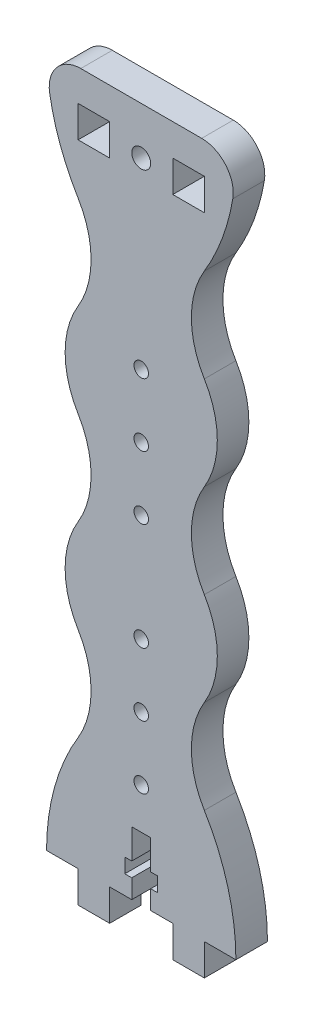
ISO-10303-21;
HEADER;
FILE_DESCRIPTION(('STEP AP214'),'2;1');
FILE_NAME('part.step','',(''),(''),'','','');
FILE_SCHEMA(('AUTOMOTIVE_DESIGN { 1 0 10303 214 1 1 1 1 }'));
ENDSEC;
DATA;
#1=APPLICATION_CONTEXT('core data for automotive mechanical design processes');
#2=APPLICATION_PROTOCOL_DEFINITION('international standard','automotive_design',2000,#1);
#3=PRODUCT_CONTEXT('',#1,'mechanical');
#4=PRODUCT('Part','Part','',(#3));
#5=PRODUCT_RELATED_PRODUCT_CATEGORY('part','',(#4));
#6=PRODUCT_DEFINITION_FORMATION('','',#4);
#7=PRODUCT_DEFINITION_CONTEXT('part definition',#1,'design');
#8=PRODUCT_DEFINITION('design','',#6,#7);
#9=PRODUCT_DEFINITION_SHAPE('','',#8);
#10=(LENGTH_UNIT() NAMED_UNIT(*) SI_UNIT(.MILLI.,.METRE.));
#11=(NAMED_UNIT(*) PLANE_ANGLE_UNIT() SI_UNIT($,.RADIAN.));
#12=(NAMED_UNIT(*) SI_UNIT($,.STERADIAN.) SOLID_ANGLE_UNIT());
#13=UNCERTAINTY_MEASURE_WITH_UNIT(LENGTH_MEASURE(1.E-05),#10,'distance_accuracy_value','');
#14=(GEOMETRIC_REPRESENTATION_CONTEXT(3) GLOBAL_UNCERTAINTY_ASSIGNED_CONTEXT((#13)) GLOBAL_UNIT_ASSIGNED_CONTEXT((#10,
#11,#12)) REPRESENTATION_CONTEXT('',''));
#15=CARTESIAN_POINT('',(0.,0.,0.));
#16=DIRECTION('',(0.,0.,1.));
#17=DIRECTION('',(1.,0.,0.));
#18=AXIS2_PLACEMENT_3D('',#15,#16,#17);
#19=CARTESIAN_POINT('',(34.9,0.,5.));
#20=DIRECTION('',(0.,0.,1.));
#21=DIRECTION('',(1.,0.,0.));
#22=AXIS2_PLACEMENT_3D('',#19,#20,#21);
#23=PLANE('',#22);
#24=DIRECTION('',(1.,0.,0.));
#25=VECTOR('',#24,1.);
#26=CARTESIAN_POINT('',(20.,100.,5.));
#27=LINE('',#26,#25);
#28=CARTESIAN_POINT('',(20.,100.,5.));
#29=VERTEX_POINT('',#28);
#30=CARTESIAN_POINT('',(25.,100.,5.));
#31=VERTEX_POINT('',#30);
#32=EDGE_CURVE('E342',#29,#31,#27,.T.);
#33=ORIENTED_EDGE('',*,*,#32,.F.);
#34=DIRECTION('',(0.,-1.,0.));
#35=VECTOR('',#34,1.);
#36=CARTESIAN_POINT('',(20.,105.,5.));
#37=LINE('',#36,#35);
#38=CARTESIAN_POINT('',(20.,105.,5.));
#39=VERTEX_POINT('',#38);
#40=EDGE_CURVE('E332',#39,#29,#37,.T.);
#41=ORIENTED_EDGE('',*,*,#40,.F.);
#42=DIRECTION('',(-1.,0.,0.));
#43=VECTOR('',#42,1.);
#44=CARTESIAN_POINT('',(20.,105.,5.));
#45=LINE('',#44,#43);
#46=CARTESIAN_POINT('',(25.,105.,5.));
#47=VERTEX_POINT('',#46);
#48=EDGE_CURVE('E358',#47,#39,#45,.T.);
#49=ORIENTED_EDGE('',*,*,#48,.F.);
#50=DIRECTION('',(0.,1.,0.));
#51=VECTOR('',#50,1.);
#52=CARTESIAN_POINT('',(25.,105.,5.));
#53=LINE('',#52,#51);
#54=EDGE_CURVE('E356',#31,#47,#53,.T.);
#55=ORIENTED_EDGE('',*,*,#54,.F.);
#56=EDGE_LOOP('',(#33,#41,#49,#55));
#57=FACE_BOUND('',#56,.T.);
#58=DIRECTION('',(-1.,0.,0.));
#59=VECTOR('',#58,1.);
#60=CARTESIAN_POINT('',(10.,105.,5.));
#61=LINE('',#60,#59);
#62=CARTESIAN_POINT('',(10.,105.,5.));
#63=VERTEX_POINT('',#62);
#64=CARTESIAN_POINT('',(5.00000000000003,105.,5.));
#65=VERTEX_POINT('',#64);
#66=EDGE_CURVE('E378',#63,#65,#61,.T.);
#67=ORIENTED_EDGE('',*,*,#66,.F.);
#68=DIRECTION('',(0.,1.,0.));
#69=VECTOR('',#68,1.);
#70=CARTESIAN_POINT('',(10.,105.,5.));
#71=LINE('',#70,#69);
#72=CARTESIAN_POINT('',(10.,100.,5.));
#73=VERTEX_POINT('',#72);
#74=EDGE_CURVE('E376',#73,#63,#71,.T.);
#75=ORIENTED_EDGE('',*,*,#74,.F.);
#76=DIRECTION('',(1.,0.,0.));
#77=VECTOR('',#76,1.);
#78=CARTESIAN_POINT('',(10.,100.,5.));
#79=LINE('',#78,#77);
#80=CARTESIAN_POINT('',(5.00000000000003,100.,5.));
#81=VERTEX_POINT('',#80);
#82=EDGE_CURVE('E384',#81,#73,#79,.T.);
#83=ORIENTED_EDGE('',*,*,#82,.F.);
#84=DIRECTION('',(0.,-1.,0.));
#85=VECTOR('',#84,1.);
#86=CARTESIAN_POINT('',(5.00000000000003,105.,5.));
#87=LINE('',#86,#85);
#88=EDGE_CURVE('E381',#65,#81,#87,.T.);
#89=ORIENTED_EDGE('',*,*,#88,.F.);
#90=EDGE_LOOP('',(#67,#75,#83,#89));
#91=FACE_BOUND('',#90,.T.);
#92=CARTESIAN_POINT('',(15.,36.5,5.));
#93=DIRECTION('',(0.,0.,1.));
#94=DIRECTION('',(1.,0.,0.));
#95=AXIS2_PLACEMENT_3D('',#92,#93,#94);
#96=CIRCLE('',#95,1.15);
#97=CARTESIAN_POINT('',(16.15,36.5,5.));
#98=VERTEX_POINT('',#97);
#99=EDGE_CURVE('E407',#98,#98,#96,.T.);
#100=ORIENTED_EDGE('',*,*,#99,.F.);
#101=EDGE_LOOP('',(#100));
#102=FACE_BOUND('',#101,.T.);
#103=CARTESIAN_POINT('',(15.0000000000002,16.5,5.));
#104=DIRECTION('',(0.,0.,1.));
#105=DIRECTION('',(1.,0.,0.));
#106=AXIS2_PLACEMENT_3D('',#103,#104,#105);
#107=CIRCLE('',#106,1.15);
#108=CARTESIAN_POINT('',(16.1500000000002,16.5,5.));
#109=VERTEX_POINT('',#108);
#110=EDGE_CURVE('E419',#109,#109,#107,.T.);
#111=ORIENTED_EDGE('',*,*,#110,.F.);
#112=EDGE_LOOP('',(#111));
#113=FACE_BOUND('',#112,.T.);
#114=CARTESIAN_POINT('',(15.0000000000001,26.5,5.));
#115=DIRECTION('',(0.,0.,1.));
#116=DIRECTION('',(1.,0.,0.));
#117=AXIS2_PLACEMENT_3D('',#114,#115,#116);
#118=CIRCLE('',#117,1.15);
#119=CARTESIAN_POINT('',(16.1500000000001,26.5,5.));
#120=VERTEX_POINT('',#119);
#121=EDGE_CURVE('E431',#120,#120,#118,.T.);
#122=ORIENTED_EDGE('',*,*,#121,.F.);
#123=EDGE_LOOP('',(#122));
#124=FACE_BOUND('',#123,.T.);
#125=DIRECTION('',(-1.,0.,0.));
#126=VECTOR('',#125,1.);
#127=CARTESIAN_POINT('',(0.,110.,5.));
#128=LINE('',#127,#126);
#129=CARTESIAN_POINT('',(24.5789755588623,110.,5.));
#130=VERTEX_POINT('',#129);
#131=CARTESIAN_POINT('',(5.42102444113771,110.,5.));
#132=VERTEX_POINT('',#131);
#133=EDGE_CURVE('E503',#130,#132,#128,.T.);
#134=ORIENTED_EDGE('',*,*,#133,.T.);
#135=CARTESIAN_POINT('',(5.42102444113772,105.,5.));
#136=DIRECTION('',(0.,0.,1.));
#137=DIRECTION('',(1.,0.,0.));
#138=AXIS2_PLACEMENT_3D('',#135,#136,#137);
#139=CIRCLE('',#138,5.);
#140=CARTESIAN_POINT('',(0.491429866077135,104.163879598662,5.));
#141=VERTEX_POINT('',#140);
#142=EDGE_CURVE('E44',#132,#141,#139,.T.);
#143=ORIENTED_EDGE('',*,*,#142,.T.);
#144=CARTESIAN_POINT('',(34.8999999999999,110.,5.));
#145=DIRECTION('',(0.,0.,1.));
#146=DIRECTION('',(1.,0.,0.));
#147=AXIS2_PLACEMENT_3D('',#144,#145,#146);
#148=CIRCLE('',#147,34.8999999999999);
#149=CARTESIAN_POINT('',(4.99999999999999,92.0000000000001,5.));
#150=VERTEX_POINT('',#149);
#151=EDGE_CURVE('E505',#141,#150,#148,.T.);
#152=ORIENTED_EDGE('',*,*,#151,.T.);
#153=CARTESIAN_POINT('',(-7.29222222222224,84.6,5.));
#154=DIRECTION('',(0.,0.,-1.));
#155=DIRECTION('',(-1.,0.,0.));
#156=AXIS2_PLACEMENT_3D('',#153,#154,#155);
#157=CIRCLE('',#156,14.3477777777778);
#158=CARTESIAN_POINT('',(5.00000000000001,77.2,5.));
#159=VERTEX_POINT('',#158);
#160=EDGE_CURVE('E507',#150,#159,#157,.T.);
#161=ORIENTED_EDGE('',*,*,#160,.T.);
#162=CARTESIAN_POINT('',(17.2922222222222,69.8,5.));
#163=DIRECTION('',(0.,0.,1.));
#164=DIRECTION('',(1.,0.,0.));
#165=AXIS2_PLACEMENT_3D('',#162,#163,#164);
#166=CIRCLE('',#165,14.3477777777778);
#167=CARTESIAN_POINT('',(5.,62.4,5.));
#168=VERTEX_POINT('',#167);
#169=EDGE_CURVE('E509',#159,#168,#166,.T.);
#170=ORIENTED_EDGE('',*,*,#169,.T.);
#171=CARTESIAN_POINT('',(-7.29222222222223,55.,5.));
#172=DIRECTION('',(0.,0.,-1.));
#173=DIRECTION('',(-1.,0.,0.));
#174=AXIS2_PLACEMENT_3D('',#171,#172,#173);
#175=CIRCLE('',#174,14.3477777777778);
#176=CARTESIAN_POINT('',(5.,47.6,5.));
#177=VERTEX_POINT('',#176);
#178=EDGE_CURVE('E511',#168,#177,#175,.T.);
#179=ORIENTED_EDGE('',*,*,#178,.T.);
#180=CARTESIAN_POINT('',(17.2922222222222,40.2,5.));
#181=DIRECTION('',(0.,0.,1.));
#182=DIRECTION('',(1.,0.,0.));
#183=AXIS2_PLACEMENT_3D('',#180,#181,#182);
#184=CIRCLE('',#183,14.3477777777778);
#185=CARTESIAN_POINT('',(4.99999999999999,32.8,5.));
#186=VERTEX_POINT('',#185);
#187=EDGE_CURVE('E513',#177,#186,#184,.T.);
#188=ORIENTED_EDGE('',*,*,#187,.T.);
#189=CARTESIAN_POINT('',(-7.29222222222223,25.4,5.));
#190=DIRECTION('',(0.,0.,-1.));
#191=DIRECTION('',(-1.,0.,0.));
#192=AXIS2_PLACEMENT_3D('',#189,#190,#191);
#193=CIRCLE('',#192,14.3477777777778);
#194=CARTESIAN_POINT('',(5.,18.,5.));
#195=VERTEX_POINT('',#194);
#196=EDGE_CURVE('E515',#186,#195,#193,.T.);
#197=ORIENTED_EDGE('',*,*,#196,.T.);
#198=CARTESIAN_POINT('',(34.9,0.,5.));
#199=DIRECTION('',(0.,0.,1.));
#200=DIRECTION('',(1.,0.,0.));
#201=AXIS2_PLACEMENT_3D('',#198,#199,#200);
#202=CIRCLE('',#201,34.9);
#203=CARTESIAN_POINT('',(0.,0.,5.));
#204=VERTEX_POINT('',#203);
#205=EDGE_CURVE('E443',#195,#204,#202,.T.);
#206=ORIENTED_EDGE('',*,*,#205,.T.);
#207=DIRECTION('',(1.,0.,0.));
#208=VECTOR('',#207,1.);
#209=CARTESIAN_POINT('',(5.,0.,5.));
#210=LINE('',#209,#208);
#211=CARTESIAN_POINT('',(5.,0.,5.));
#212=VERTEX_POINT('',#211);
#213=EDGE_CURVE('E446',#204,#212,#210,.T.);
#214=ORIENTED_EDGE('',*,*,#213,.T.);
#215=DIRECTION('',(0.,-1.,0.));
#216=VECTOR('',#215,1.);
#217=CARTESIAN_POINT('',(5.,-5.,5.));
#218=LINE('',#217,#216);
#219=CARTESIAN_POINT('',(5.,-5.,5.));
#220=VERTEX_POINT('',#219);
#221=EDGE_CURVE('E449',#212,#220,#218,.T.);
#222=ORIENTED_EDGE('',*,*,#221,.T.);
#223=DIRECTION('',(1.,0.,0.));
#224=VECTOR('',#223,1.);
#225=CARTESIAN_POINT('',(10.,-5.,5.));
#226=LINE('',#225,#224);
#227=CARTESIAN_POINT('',(10.,-5.,5.));
#228=VERTEX_POINT('',#227);
#229=EDGE_CURVE('E451',#220,#228,#226,.T.);
#230=ORIENTED_EDGE('',*,*,#229,.T.);
#231=DIRECTION('',(0.,1.,0.));
#232=VECTOR('',#231,1.);
#233=CARTESIAN_POINT('',(10.,-5.,5.));
#234=LINE('',#233,#232);
#235=CARTESIAN_POINT('',(10.,0.,5.));
#236=VERTEX_POINT('',#235);
#237=EDGE_CURVE('E453',#228,#236,#234,.T.);
#238=ORIENTED_EDGE('',*,*,#237,.T.);
#239=DIRECTION('',(1.,0.,0.));
#240=VECTOR('',#239,1.);
#241=CARTESIAN_POINT('',(13.5,0.,5.));
#242=LINE('',#241,#240);
#243=CARTESIAN_POINT('',(13.5,0.,5.));
#244=VERTEX_POINT('',#243);
#245=EDGE_CURVE('E455',#236,#244,#242,.T.);
#246=ORIENTED_EDGE('',*,*,#245,.T.);
#247=DIRECTION('',(0.,1.,0.));
#248=VECTOR('',#247,1.);
#249=CARTESIAN_POINT('',(13.5,3.00000000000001,5.));
#250=LINE('',#249,#248);
#251=CARTESIAN_POINT('',(13.5,3.00000000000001,5.));
#252=VERTEX_POINT('',#251);
#253=EDGE_CURVE('E457',#244,#252,#250,.T.);
#254=ORIENTED_EDGE('',*,*,#253,.T.);
#255=DIRECTION('',(-1.,0.,0.));
#256=VECTOR('',#255,1.);
#257=CARTESIAN_POINT('',(13.5,3.00000000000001,5.));
#258=LINE('',#257,#256);
#259=CARTESIAN_POINT('',(12.4,3.00000000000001,5.));
#260=VERTEX_POINT('',#259);
#261=EDGE_CURVE('E459',#252,#260,#258,.T.);
#262=ORIENTED_EDGE('',*,*,#261,.T.);
#263=DIRECTION('',(0.,1.,0.));
#264=VECTOR('',#263,1.);
#265=CARTESIAN_POINT('',(12.4,3.00000000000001,5.));
#266=LINE('',#265,#264);
#267=CARTESIAN_POINT('',(12.4,5.3,5.));
#268=VERTEX_POINT('',#267);
#269=EDGE_CURVE('E461',#260,#268,#266,.T.);
#270=ORIENTED_EDGE('',*,*,#269,.T.);
#271=DIRECTION('',(1.,0.,0.));
#272=VECTOR('',#271,1.);
#273=CARTESIAN_POINT('',(12.4,5.3,5.));
#274=LINE('',#273,#272);
#275=CARTESIAN_POINT('',(13.5,5.3,5.));
#276=VERTEX_POINT('',#275);
#277=EDGE_CURVE('E463',#268,#276,#274,.T.);
#278=ORIENTED_EDGE('',*,*,#277,.T.);
#279=DIRECTION('',(0.,1.,0.));
#280=VECTOR('',#279,1.);
#281=CARTESIAN_POINT('',(13.5,10.,5.));
#282=LINE('',#281,#280);
#283=CARTESIAN_POINT('',(13.5,10.,5.));
#284=VERTEX_POINT('',#283);
#285=EDGE_CURVE('E465',#276,#284,#282,.T.);
#286=ORIENTED_EDGE('',*,*,#285,.T.);
#287=DIRECTION('',(1.,0.,0.));
#288=VECTOR('',#287,1.);
#289=CARTESIAN_POINT('',(16.5,10.,5.));
#290=LINE('',#289,#288);
#291=CARTESIAN_POINT('',(16.5,10.,5.));
#292=VERTEX_POINT('',#291);
#293=EDGE_CURVE('E467',#284,#292,#290,.T.);
#294=ORIENTED_EDGE('',*,*,#293,.T.);
#295=DIRECTION('',(0.,-1.,0.));
#296=VECTOR('',#295,1.);
#297=CARTESIAN_POINT('',(16.5,5.3,5.));
#298=LINE('',#297,#296);
#299=CARTESIAN_POINT('',(16.5,5.3,5.));
#300=VERTEX_POINT('',#299);
#301=EDGE_CURVE('E469',#292,#300,#298,.T.);
#302=ORIENTED_EDGE('',*,*,#301,.T.);
#303=DIRECTION('',(1.,0.,0.));
#304=VECTOR('',#303,1.);
#305=CARTESIAN_POINT('',(16.5,5.3,5.));
#306=LINE('',#305,#304);
#307=CARTESIAN_POINT('',(17.6,5.3,5.));
#308=VERTEX_POINT('',#307);
#309=EDGE_CURVE('E471',#300,#308,#306,.T.);
#310=ORIENTED_EDGE('',*,*,#309,.T.);
#311=DIRECTION('',(0.,-1.,0.));
#312=VECTOR('',#311,1.);
#313=CARTESIAN_POINT('',(17.6,5.3,5.));
#314=LINE('',#313,#312);
#315=CARTESIAN_POINT('',(17.6,3.00000000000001,5.));
#316=VERTEX_POINT('',#315);
#317=EDGE_CURVE('E473',#308,#316,#314,.T.);
#318=ORIENTED_EDGE('',*,*,#317,.T.);
#319=DIRECTION('',(-1.,0.,0.));
#320=VECTOR('',#319,1.);
#321=CARTESIAN_POINT('',(17.6,3.00000000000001,5.));
#322=LINE('',#321,#320);
#323=CARTESIAN_POINT('',(16.5,3.00000000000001,5.));
#324=VERTEX_POINT('',#323);
#325=EDGE_CURVE('E475',#316,#324,#322,.T.);
#326=ORIENTED_EDGE('',*,*,#325,.T.);
#327=DIRECTION('',(0.,-1.,0.));
#328=VECTOR('',#327,1.);
#329=CARTESIAN_POINT('',(16.5,0.,5.));
#330=LINE('',#329,#328);
#331=CARTESIAN_POINT('',(16.5,0.,5.));
#332=VERTEX_POINT('',#331);
#333=EDGE_CURVE('E477',#324,#332,#330,.T.);
#334=ORIENTED_EDGE('',*,*,#333,.T.);
#335=DIRECTION('',(1.,0.,0.));
#336=VECTOR('',#335,1.);
#337=CARTESIAN_POINT('',(16.5,0.,5.));
#338=LINE('',#337,#336);
#339=CARTESIAN_POINT('',(20.,0.,5.));
#340=VERTEX_POINT('',#339);
#341=EDGE_CURVE('E479',#332,#340,#338,.T.);
#342=ORIENTED_EDGE('',*,*,#341,.T.);
#343=DIRECTION('',(0.,-1.,0.));
#344=VECTOR('',#343,1.);
#345=CARTESIAN_POINT('',(20.,0.,5.));
#346=LINE('',#345,#344);
#347=CARTESIAN_POINT('',(20.,-5.,5.));
#348=VERTEX_POINT('',#347);
#349=EDGE_CURVE('E481',#340,#348,#346,.T.);
#350=ORIENTED_EDGE('',*,*,#349,.T.);
#351=DIRECTION('',(1.,0.,0.));
#352=VECTOR('',#351,1.);
#353=CARTESIAN_POINT('',(20.,-5.,5.));
#354=LINE('',#353,#352);
#355=CARTESIAN_POINT('',(25.,-5.,5.));
#356=VERTEX_POINT('',#355);
#357=EDGE_CURVE('E483',#348,#356,#354,.T.);
#358=ORIENTED_EDGE('',*,*,#357,.T.);
#359=DIRECTION('',(0.,1.,0.));
#360=VECTOR('',#359,1.);
#361=CARTESIAN_POINT('',(25.,-5.,5.));
#362=LINE('',#361,#360);
#363=CARTESIAN_POINT('',(25.,0.,5.));
#364=VERTEX_POINT('',#363);
#365=EDGE_CURVE('E485',#356,#364,#362,.T.);
#366=ORIENTED_EDGE('',*,*,#365,.T.);
#367=DIRECTION('',(1.,0.,0.));
#368=VECTOR('',#367,1.);
#369=CARTESIAN_POINT('',(30.,0.,5.));
#370=LINE('',#369,#368);
#371=CARTESIAN_POINT('',(30.,0.,5.));
#372=VERTEX_POINT('',#371);
#373=EDGE_CURVE('E487',#364,#372,#370,.T.);
#374=ORIENTED_EDGE('',*,*,#373,.T.);
#375=CARTESIAN_POINT('',(-4.89999999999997,0.,5.));
#376=DIRECTION('',(0.,0.,1.));
#377=DIRECTION('',(-1.,0.,0.));
#378=AXIS2_PLACEMENT_3D('',#375,#376,#377);
#379=CIRCLE('',#378,34.9);
#380=CARTESIAN_POINT('',(25.,18.,5.));
#381=VERTEX_POINT('',#380);
#382=EDGE_CURVE('E489',#372,#381,#379,.T.);
#383=ORIENTED_EDGE('',*,*,#382,.T.);
#384=CARTESIAN_POINT('',(37.2922222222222,25.4,5.));
#385=DIRECTION('',(0.,0.,-1.));
#386=DIRECTION('',(1.,0.,0.));
#387=AXIS2_PLACEMENT_3D('',#384,#385,#386);
#388=CIRCLE('',#387,14.3477777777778);
#389=CARTESIAN_POINT('',(25.,32.8,5.));
#390=VERTEX_POINT('',#389);
#391=EDGE_CURVE('E491',#381,#390,#388,.T.);
#392=ORIENTED_EDGE('',*,*,#391,.T.);
#393=CARTESIAN_POINT('',(12.7077777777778,40.2,5.));
#394=DIRECTION('',(0.,0.,1.));
#395=DIRECTION('',(-1.,0.,0.));
#396=AXIS2_PLACEMENT_3D('',#393,#394,#395);
#397=CIRCLE('',#396,14.3477777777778);
#398=CARTESIAN_POINT('',(25.,47.6,5.));
#399=VERTEX_POINT('',#398);
#400=EDGE_CURVE('E493',#390,#399,#397,.T.);
#401=ORIENTED_EDGE('',*,*,#400,.T.);
#402=CARTESIAN_POINT('',(37.2922222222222,55.,5.));
#403=DIRECTION('',(0.,0.,-1.));
#404=DIRECTION('',(1.,0.,0.));
#405=AXIS2_PLACEMENT_3D('',#402,#403,#404);
#406=CIRCLE('',#405,14.3477777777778);
#407=CARTESIAN_POINT('',(25.,62.4,5.));
#408=VERTEX_POINT('',#407);
#409=EDGE_CURVE('E495',#399,#408,#406,.T.);
#410=ORIENTED_EDGE('',*,*,#409,.T.);
#411=CARTESIAN_POINT('',(12.7077777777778,69.8,5.));
#412=DIRECTION('',(0.,0.,1.));
#413=DIRECTION('',(-1.,0.,0.));
#414=AXIS2_PLACEMENT_3D('',#411,#412,#413);
#415=CIRCLE('',#414,14.3477777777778);
#416=CARTESIAN_POINT('',(25.,77.2,5.));
#417=VERTEX_POINT('',#416);
#418=EDGE_CURVE('E497',#408,#417,#415,.T.);
#419=ORIENTED_EDGE('',*,*,#418,.T.);
#420=CARTESIAN_POINT('',(37.2922222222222,84.6,5.));
#421=DIRECTION('',(0.,0.,-1.));
#422=DIRECTION('',(1.,0.,0.));
#423=AXIS2_PLACEMENT_3D('',#420,#421,#422);
#424=CIRCLE('',#423,14.3477777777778);
#425=CARTESIAN_POINT('',(25.,92.0000000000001,5.));
#426=VERTEX_POINT('',#425);
#427=EDGE_CURVE('E499',#417,#426,#424,.T.);
#428=ORIENTED_EDGE('',*,*,#427,.T.);
#429=CARTESIAN_POINT('',(-4.89999999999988,110.,5.));
#430=DIRECTION('',(0.,0.,1.));
#431=DIRECTION('',(-1.,0.,0.));
#432=AXIS2_PLACEMENT_3D('',#429,#430,#431);
#433=CIRCLE('',#432,34.8999999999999);
#434=CARTESIAN_POINT('',(29.5085701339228,104.163879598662,5.));
#435=VERTEX_POINT('',#434);
#436=EDGE_CURVE('E501',#426,#435,#433,.T.);
#437=ORIENTED_EDGE('',*,*,#436,.T.);
#438=CARTESIAN_POINT('',(24.5789755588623,105.,5.));
#439=DIRECTION('',(0.,0.,1.));
#440=DIRECTION('',(1.,0.,0.));
#441=AXIS2_PLACEMENT_3D('',#438,#439,#440);
#442=CIRCLE('',#441,5.);
#443=EDGE_CURVE('E701',#435,#130,#442,.T.);
#444=ORIENTED_EDGE('',*,*,#443,.T.);
#445=EDGE_LOOP('',(#134,#143,#152,#161,#170,#179,#188,#197,#206,#214,#222,#230,#238,#246,#254,
#262,#270,#278,#286,#294,#302,#310,#318,#326,#334,#342,#350,#358,#366,#374,#383,#392,#401,#410,
#419,#428,#437,#444));
#446=FACE_BOUND('',#445,.T.);
#447=CARTESIAN_POINT('',(15.0000000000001,63.5,5.));
#448=DIRECTION('',(0.,0.,1.));
#449=DIRECTION('',(1.,0.,0.));
#450=AXIS2_PLACEMENT_3D('',#447,#448,#449);
#451=CIRCLE('',#450,1.15);
#452=CARTESIAN_POINT('',(16.1500000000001,63.5,5.));
#453=VERTEX_POINT('',#452);
#454=EDGE_CURVE('E437',#453,#453,#451,.T.);
#455=ORIENTED_EDGE('',*,*,#454,.F.);
#456=EDGE_LOOP('',(#455));
#457=FACE_BOUND('',#456,.T.);
#458=CARTESIAN_POINT('',(15.0000000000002,53.5,5.));
#459=DIRECTION('',(0.,0.,1.));
#460=DIRECTION('',(1.,0.,0.));
#461=AXIS2_PLACEMENT_3D('',#458,#459,#460);
#462=CIRCLE('',#461,1.15);
#463=CARTESIAN_POINT('',(16.1500000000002,53.5,5.));
#464=VERTEX_POINT('',#463);
#465=EDGE_CURVE('E425',#464,#464,#462,.T.);
#466=ORIENTED_EDGE('',*,*,#465,.F.);
#467=EDGE_LOOP('',(#466));
#468=FACE_BOUND('',#467,.T.);
#469=CARTESIAN_POINT('',(15.,73.5,5.));
#470=DIRECTION('',(0.,0.,1.));
#471=DIRECTION('',(1.,0.,0.));
#472=AXIS2_PLACEMENT_3D('',#469,#470,#471);
#473=CIRCLE('',#472,1.15);
#474=CARTESIAN_POINT('',(16.15,73.5,5.));
#475=VERTEX_POINT('',#474);
#476=EDGE_CURVE('E413',#475,#475,#473,.T.);
#477=ORIENTED_EDGE('',*,*,#476,.F.);
#478=EDGE_LOOP('',(#477));
#479=FACE_BOUND('',#478,.T.);
#480=CARTESIAN_POINT('',(15.,102.5,5.));
#481=DIRECTION('',(0.,0.,1.));
#482=DIRECTION('',(1.,0.,0.));
#483=AXIS2_PLACEMENT_3D('',#480,#481,#482);
#484=CIRCLE('',#483,1.5);
#485=CARTESIAN_POINT('',(16.5,102.5,5.));
#486=VERTEX_POINT('',#485);
#487=EDGE_CURVE('E365',#486,#486,#484,.T.);
#488=ORIENTED_EDGE('',*,*,#487,.F.);
#489=EDGE_LOOP('',(#488));
#490=FACE_BOUND('',#489,.T.);
#491=ADVANCED_FACE('F36',(#57,#91,#102,#113,#124,#446,#457,#468,#479,#490),#23,.T.);
#492=CARTESIAN_POINT('',(34.9,0.,0.));
#493=DIRECTION('',(0.,0.,1.));
#494=DIRECTION('',(1.,0.,0.));
#495=AXIS2_PLACEMENT_3D('',#492,#493,#494);
#496=PLANE('',#495);
#497=DIRECTION('',(0.,1.,0.));
#498=VECTOR('',#497,1.);
#499=CARTESIAN_POINT('',(10.,105.,0.));
#500=LINE('',#499,#498);
#501=CARTESIAN_POINT('',(10.,100.,0.));
#502=VERTEX_POINT('',#501);
#503=CARTESIAN_POINT('',(10.,105.,0.));
#504=VERTEX_POINT('',#503);
#505=EDGE_CURVE('E350',#502,#504,#500,.T.);
#506=ORIENTED_EDGE('',*,*,#505,.T.);
#507=DIRECTION('',(-1.,0.,0.));
#508=VECTOR('',#507,1.);
#509=CARTESIAN_POINT('',(10.,105.,0.));
#510=LINE('',#509,#508);
#511=CARTESIAN_POINT('',(5.00000000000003,105.,0.));
#512=VERTEX_POINT('',#511);
#513=EDGE_CURVE('E389',#504,#512,#510,.T.);
#514=ORIENTED_EDGE('',*,*,#513,.T.);
#515=DIRECTION('',(0.,-1.,0.));
#516=VECTOR('',#515,1.);
#517=CARTESIAN_POINT('',(5.00000000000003,105.,0.));
#518=LINE('',#517,#516);
#519=CARTESIAN_POINT('',(5.00000000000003,100.,0.));
#520=VERTEX_POINT('',#519);
#521=EDGE_CURVE('E392',#512,#520,#518,.T.);
#522=ORIENTED_EDGE('',*,*,#521,.T.);
#523=DIRECTION('',(1.,0.,0.));
#524=VECTOR('',#523,1.);
#525=CARTESIAN_POINT('',(10.,100.,0.));
#526=LINE('',#525,#524);
#527=EDGE_CURVE('E379',#520,#502,#526,.T.);
#528=ORIENTED_EDGE('',*,*,#527,.T.);
#529=EDGE_LOOP('',(#506,#514,#522,#528));
#530=FACE_BOUND('',#529,.T.);
#531=CARTESIAN_POINT('',(34.8999999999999,110.,0.));
#532=DIRECTION('',(0.,0.,1.));
#533=DIRECTION('',(1.,0.,0.));
#534=AXIS2_PLACEMENT_3D('',#531,#532,#533);
#535=CIRCLE('',#534,34.8999999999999);
#536=CARTESIAN_POINT('',(0.491429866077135,104.163879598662,0.));
#537=VERTEX_POINT('',#536);
#538=CARTESIAN_POINT('',(4.99999999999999,92.0000000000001,0.));
#539=VERTEX_POINT('',#538);
#540=EDGE_CURVE('E578',#537,#539,#535,.T.);
#541=ORIENTED_EDGE('',*,*,#540,.F.);
#542=CARTESIAN_POINT('',(5.42102444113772,105.,0.));
#543=DIRECTION('',(0.,0.,1.));
#544=DIRECTION('',(1.,0.,0.));
#545=AXIS2_PLACEMENT_3D('',#542,#543,#544);
#546=CIRCLE('',#545,5.);
#547=CARTESIAN_POINT('',(5.42102444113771,110.,0.));
#548=VERTEX_POINT('',#547);
#549=EDGE_CURVE('E695',#537,#548,#546,.F.);
#550=ORIENTED_EDGE('',*,*,#549,.T.);
#551=DIRECTION('',(-1.,0.,0.));
#552=VECTOR('',#551,1.);
#553=CARTESIAN_POINT('',(0.,110.,0.));
#554=LINE('',#553,#552);
#555=CARTESIAN_POINT('',(24.5789755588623,110.,0.));
#556=VERTEX_POINT('',#555);
#557=EDGE_CURVE('E576',#556,#548,#554,.T.);
#558=ORIENTED_EDGE('',*,*,#557,.F.);
#559=CARTESIAN_POINT('',(24.5789755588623,105.,0.));
#560=DIRECTION('',(0.,0.,1.));
#561=DIRECTION('',(1.,0.,0.));
#562=AXIS2_PLACEMENT_3D('',#559,#560,#561);
#563=CIRCLE('',#562,5.);
#564=CARTESIAN_POINT('',(29.5085701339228,104.163879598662,0.));
#565=VERTEX_POINT('',#564);
#566=EDGE_CURVE('E693',#556,#565,#563,.F.);
#567=ORIENTED_EDGE('',*,*,#566,.T.);
#568=CARTESIAN_POINT('',(-4.89999999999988,110.,0.));
#569=DIRECTION('',(0.,0.,1.));
#570=DIRECTION('',(-1.,0.,0.));
#571=AXIS2_PLACEMENT_3D('',#568,#569,#570);
#572=CIRCLE('',#571,34.8999999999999);
#573=CARTESIAN_POINT('',(25.,92.0000000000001,0.));
#574=VERTEX_POINT('',#573);
#575=EDGE_CURVE('E574',#574,#565,#572,.T.);
#576=ORIENTED_EDGE('',*,*,#575,.F.);
#577=CARTESIAN_POINT('',(37.2922222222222,84.6,0.));
#578=DIRECTION('',(0.,0.,-1.));
#579=DIRECTION('',(1.,0.,0.));
#580=AXIS2_PLACEMENT_3D('',#577,#578,#579);
#581=CIRCLE('',#580,14.3477777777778);
#582=CARTESIAN_POINT('',(25.,77.2,0.));
#583=VERTEX_POINT('',#582);
#584=EDGE_CURVE('E572',#583,#574,#581,.T.);
#585=ORIENTED_EDGE('',*,*,#584,.F.);
#586=CARTESIAN_POINT('',(12.7077777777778,69.8,0.));
#587=DIRECTION('',(0.,0.,1.));
#588=DIRECTION('',(-1.,0.,0.));
#589=AXIS2_PLACEMENT_3D('',#586,#587,#588);
#590=CIRCLE('',#589,14.3477777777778);
#591=CARTESIAN_POINT('',(25.,62.4,0.));
#592=VERTEX_POINT('',#591);
#593=EDGE_CURVE('E570',#592,#583,#590,.T.);
#594=ORIENTED_EDGE('',*,*,#593,.F.);
#595=CARTESIAN_POINT('',(37.2922222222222,55.,0.));
#596=DIRECTION('',(0.,0.,-1.));
#597=DIRECTION('',(1.,0.,0.));
#598=AXIS2_PLACEMENT_3D('',#595,#596,#597);
#599=CIRCLE('',#598,14.3477777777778);
#600=CARTESIAN_POINT('',(25.,47.6,0.));
#601=VERTEX_POINT('',#600);
#602=EDGE_CURVE('E568',#601,#592,#599,.T.);
#603=ORIENTED_EDGE('',*,*,#602,.F.);
#604=CARTESIAN_POINT('',(12.7077777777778,40.2,0.));
#605=DIRECTION('',(0.,0.,1.));
#606=DIRECTION('',(-1.,0.,0.));
#607=AXIS2_PLACEMENT_3D('',#604,#605,#606);
#608=CIRCLE('',#607,14.3477777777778);
#609=CARTESIAN_POINT('',(25.,32.8,0.));
#610=VERTEX_POINT('',#609);
#611=EDGE_CURVE('E566',#610,#601,#608,.T.);
#612=ORIENTED_EDGE('',*,*,#611,.F.);
#613=CARTESIAN_POINT('',(37.2922222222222,25.4,0.));
#614=DIRECTION('',(0.,0.,-1.));
#615=DIRECTION('',(1.,0.,0.));
#616=AXIS2_PLACEMENT_3D('',#613,#614,#615);
#617=CIRCLE('',#616,14.3477777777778);
#618=CARTESIAN_POINT('',(25.,18.,0.));
#619=VERTEX_POINT('',#618);
#620=EDGE_CURVE('E564',#619,#610,#617,.T.);
#621=ORIENTED_EDGE('',*,*,#620,.F.);
#622=CARTESIAN_POINT('',(-4.89999999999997,0.,0.));
#623=DIRECTION('',(0.,0.,1.));
#624=DIRECTION('',(-1.,0.,0.));
#625=AXIS2_PLACEMENT_3D('',#622,#623,#624);
#626=CIRCLE('',#625,34.9);
#627=CARTESIAN_POINT('',(30.,0.,0.));
#628=VERTEX_POINT('',#627);
#629=EDGE_CURVE('E562',#628,#619,#626,.T.);
#630=ORIENTED_EDGE('',*,*,#629,.F.);
#631=DIRECTION('',(1.,0.,0.));
#632=VECTOR('',#631,1.);
#633=CARTESIAN_POINT('',(30.,0.,0.));
#634=LINE('',#633,#632);
#635=CARTESIAN_POINT('',(25.,0.,0.));
#636=VERTEX_POINT('',#635);
#637=EDGE_CURVE('E560',#636,#628,#634,.T.);
#638=ORIENTED_EDGE('',*,*,#637,.F.);
#639=DIRECTION('',(0.,1.,0.));
#640=VECTOR('',#639,1.);
#641=CARTESIAN_POINT('',(25.,-5.,0.));
#642=LINE('',#641,#640);
#643=CARTESIAN_POINT('',(25.,-5.,0.));
#644=VERTEX_POINT('',#643);
#645=EDGE_CURVE('E558',#644,#636,#642,.T.);
#646=ORIENTED_EDGE('',*,*,#645,.F.);
#647=DIRECTION('',(1.,0.,0.));
#648=VECTOR('',#647,1.);
#649=CARTESIAN_POINT('',(20.,-5.,0.));
#650=LINE('',#649,#648);
#651=CARTESIAN_POINT('',(20.,-5.,0.));
#652=VERTEX_POINT('',#651);
#653=EDGE_CURVE('E556',#652,#644,#650,.T.);
#654=ORIENTED_EDGE('',*,*,#653,.F.);
#655=DIRECTION('',(0.,-1.,0.));
#656=VECTOR('',#655,1.);
#657=CARTESIAN_POINT('',(20.,0.,0.));
#658=LINE('',#657,#656);
#659=CARTESIAN_POINT('',(20.,0.,0.));
#660=VERTEX_POINT('',#659);
#661=EDGE_CURVE('E554',#660,#652,#658,.T.);
#662=ORIENTED_EDGE('',*,*,#661,.F.);
#663=DIRECTION('',(1.,0.,0.));
#664=VECTOR('',#663,1.);
#665=CARTESIAN_POINT('',(16.5,0.,0.));
#666=LINE('',#665,#664);
#667=CARTESIAN_POINT('',(16.5,0.,0.));
#668=VERTEX_POINT('',#667);
#669=EDGE_CURVE('E552',#668,#660,#666,.T.);
#670=ORIENTED_EDGE('',*,*,#669,.F.);
#671=DIRECTION('',(0.,-1.,0.));
#672=VECTOR('',#671,1.);
#673=CARTESIAN_POINT('',(16.5,0.,0.));
#674=LINE('',#673,#672);
#675=CARTESIAN_POINT('',(16.5,3.00000000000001,0.));
#676=VERTEX_POINT('',#675);
#677=EDGE_CURVE('E550',#676,#668,#674,.T.);
#678=ORIENTED_EDGE('',*,*,#677,.F.);
#679=DIRECTION('',(-1.,0.,0.));
#680=VECTOR('',#679,1.);
#681=CARTESIAN_POINT('',(17.6,3.00000000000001,0.));
#682=LINE('',#681,#680);
#683=CARTESIAN_POINT('',(17.6,3.00000000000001,0.));
#684=VERTEX_POINT('',#683);
#685=EDGE_CURVE('E548',#684,#676,#682,.T.);
#686=ORIENTED_EDGE('',*,*,#685,.F.);
#687=DIRECTION('',(0.,-1.,0.));
#688=VECTOR('',#687,1.);
#689=CARTESIAN_POINT('',(17.6,5.3,0.));
#690=LINE('',#689,#688);
#691=CARTESIAN_POINT('',(17.6,5.3,0.));
#692=VERTEX_POINT('',#691);
#693=EDGE_CURVE('E546',#692,#684,#690,.T.);
#694=ORIENTED_EDGE('',*,*,#693,.F.);
#695=DIRECTION('',(1.,0.,0.));
#696=VECTOR('',#695,1.);
#697=CARTESIAN_POINT('',(16.5,5.3,0.));
#698=LINE('',#697,#696);
#699=CARTESIAN_POINT('',(16.5,5.3,0.));
#700=VERTEX_POINT('',#699);
#701=EDGE_CURVE('E544',#700,#692,#698,.T.);
#702=ORIENTED_EDGE('',*,*,#701,.F.);
#703=DIRECTION('',(0.,-1.,0.));
#704=VECTOR('',#703,1.);
#705=CARTESIAN_POINT('',(16.5,5.3,0.));
#706=LINE('',#705,#704);
#707=CARTESIAN_POINT('',(16.5,10.,0.));
#708=VERTEX_POINT('',#707);
#709=EDGE_CURVE('E542',#708,#700,#706,.T.);
#710=ORIENTED_EDGE('',*,*,#709,.F.);
#711=DIRECTION('',(1.,0.,0.));
#712=VECTOR('',#711,1.);
#713=CARTESIAN_POINT('',(16.5,10.,0.));
#714=LINE('',#713,#712);
#715=CARTESIAN_POINT('',(13.5,10.,0.));
#716=VERTEX_POINT('',#715);
#717=EDGE_CURVE('E540',#716,#708,#714,.T.);
#718=ORIENTED_EDGE('',*,*,#717,.F.);
#719=DIRECTION('',(0.,1.,0.));
#720=VECTOR('',#719,1.);
#721=CARTESIAN_POINT('',(13.5,10.,0.));
#722=LINE('',#721,#720);
#723=CARTESIAN_POINT('',(13.5,5.3,0.));
#724=VERTEX_POINT('',#723);
#725=EDGE_CURVE('E538',#724,#716,#722,.T.);
#726=ORIENTED_EDGE('',*,*,#725,.F.);
#727=DIRECTION('',(1.,0.,0.));
#728=VECTOR('',#727,1.);
#729=CARTESIAN_POINT('',(12.4,5.3,0.));
#730=LINE('',#729,#728);
#731=CARTESIAN_POINT('',(12.4,5.3,0.));
#732=VERTEX_POINT('',#731);
#733=EDGE_CURVE('E536',#732,#724,#730,.T.);
#734=ORIENTED_EDGE('',*,*,#733,.F.);
#735=DIRECTION('',(0.,1.,0.));
#736=VECTOR('',#735,1.);
#737=CARTESIAN_POINT('',(12.4,3.00000000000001,0.));
#738=LINE('',#737,#736);
#739=CARTESIAN_POINT('',(12.4,3.00000000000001,0.));
#740=VERTEX_POINT('',#739);
#741=EDGE_CURVE('E534',#740,#732,#738,.T.);
#742=ORIENTED_EDGE('',*,*,#741,.F.);
#743=DIRECTION('',(-1.,0.,0.));
#744=VECTOR('',#743,1.);
#745=CARTESIAN_POINT('',(13.5,3.00000000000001,0.));
#746=LINE('',#745,#744);
#747=CARTESIAN_POINT('',(13.5,3.00000000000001,0.));
#748=VERTEX_POINT('',#747);
#749=EDGE_CURVE('E532',#748,#740,#746,.T.);
#750=ORIENTED_EDGE('',*,*,#749,.F.);
#751=DIRECTION('',(0.,1.,0.));
#752=VECTOR('',#751,1.);
#753=CARTESIAN_POINT('',(13.5,3.00000000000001,0.));
#754=LINE('',#753,#752);
#755=CARTESIAN_POINT('',(13.5,0.,0.));
#756=VERTEX_POINT('',#755);
#757=EDGE_CURVE('E530',#756,#748,#754,.T.);
#758=ORIENTED_EDGE('',*,*,#757,.F.);
#759=DIRECTION('',(1.,0.,0.));
#760=VECTOR('',#759,1.);
#761=CARTESIAN_POINT('',(13.5,0.,0.));
#762=LINE('',#761,#760);
#763=CARTESIAN_POINT('',(10.,0.,0.));
#764=VERTEX_POINT('',#763);
#765=EDGE_CURVE('E528',#764,#756,#762,.T.);
#766=ORIENTED_EDGE('',*,*,#765,.F.);
#767=DIRECTION('',(0.,1.,0.));
#768=VECTOR('',#767,1.);
#769=CARTESIAN_POINT('',(10.,-5.,0.));
#770=LINE('',#769,#768);
#771=CARTESIAN_POINT('',(10.,-5.,0.));
#772=VERTEX_POINT('',#771);
#773=EDGE_CURVE('E526',#772,#764,#770,.T.);
#774=ORIENTED_EDGE('',*,*,#773,.F.);
#775=DIRECTION('',(1.,0.,0.));
#776=VECTOR('',#775,1.);
#777=CARTESIAN_POINT('',(10.,-5.,0.));
#778=LINE('',#777,#776);
#779=CARTESIAN_POINT('',(5.,-5.,0.));
#780=VERTEX_POINT('',#779);
#781=EDGE_CURVE('E524',#780,#772,#778,.T.);
#782=ORIENTED_EDGE('',*,*,#781,.F.);
#783=DIRECTION('',(0.,-1.,0.));
#784=VECTOR('',#783,1.);
#785=CARTESIAN_POINT('',(5.,-5.,0.));
#786=LINE('',#785,#784);
#787=CARTESIAN_POINT('',(5.,0.,0.));
#788=VERTEX_POINT('',#787);
#789=EDGE_CURVE('E522',#788,#780,#786,.T.);
#790=ORIENTED_EDGE('',*,*,#789,.F.);
#791=DIRECTION('',(1.,0.,0.));
#792=VECTOR('',#791,1.);
#793=CARTESIAN_POINT('',(5.,0.,0.));
#794=LINE('',#793,#792);
#795=CARTESIAN_POINT('',(0.,0.,0.));
#796=VERTEX_POINT('',#795);
#797=EDGE_CURVE('E520',#796,#788,#794,.T.);
#798=ORIENTED_EDGE('',*,*,#797,.F.);
#799=CARTESIAN_POINT('',(34.9,0.,0.));
#800=DIRECTION('',(0.,0.,1.));
#801=DIRECTION('',(1.,0.,0.));
#802=AXIS2_PLACEMENT_3D('',#799,#800,#801);
#803=CIRCLE('',#802,34.9);
#804=CARTESIAN_POINT('',(5.,18.,0.));
#805=VERTEX_POINT('',#804);
#806=EDGE_CURVE('E440',#805,#796,#803,.T.);
#807=ORIENTED_EDGE('',*,*,#806,.F.);
#808=CARTESIAN_POINT('',(-7.29222222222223,25.4,0.));
#809=DIRECTION('',(0.,0.,-1.));
#810=DIRECTION('',(-1.,0.,0.));
#811=AXIS2_PLACEMENT_3D('',#808,#809,#810);
#812=CIRCLE('',#811,14.3477777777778);
#813=CARTESIAN_POINT('',(4.99999999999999,32.8,0.));
#814=VERTEX_POINT('',#813);
#815=EDGE_CURVE('E447',#814,#805,#812,.T.);
#816=ORIENTED_EDGE('',*,*,#815,.F.);
#817=CARTESIAN_POINT('',(17.2922222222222,40.2,0.));
#818=DIRECTION('',(0.,0.,1.));
#819=DIRECTION('',(1.,0.,0.));
#820=AXIS2_PLACEMENT_3D('',#817,#818,#819);
#821=CIRCLE('',#820,14.3477777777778);
#822=CARTESIAN_POINT('',(5.,47.6,0.));
#823=VERTEX_POINT('',#822);
#824=EDGE_CURVE('E586',#823,#814,#821,.T.);
#825=ORIENTED_EDGE('',*,*,#824,.F.);
#826=CARTESIAN_POINT('',(-7.29222222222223,55.,0.));
#827=DIRECTION('',(0.,0.,-1.));
#828=DIRECTION('',(-1.,0.,0.));
#829=AXIS2_PLACEMENT_3D('',#826,#827,#828);
#830=CIRCLE('',#829,14.3477777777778);
#831=CARTESIAN_POINT('',(5.,62.4,0.));
#832=VERTEX_POINT('',#831);
#833=EDGE_CURVE('E584',#832,#823,#830,.T.);
#834=ORIENTED_EDGE('',*,*,#833,.F.);
#835=CARTESIAN_POINT('',(17.2922222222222,69.8,0.));
#836=DIRECTION('',(0.,0.,1.));
#837=DIRECTION('',(1.,0.,0.));
#838=AXIS2_PLACEMENT_3D('',#835,#836,#837);
#839=CIRCLE('',#838,14.3477777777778);
#840=CARTESIAN_POINT('',(5.00000000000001,77.2,0.));
#841=VERTEX_POINT('',#840);
#842=EDGE_CURVE('E582',#841,#832,#839,.T.);
#843=ORIENTED_EDGE('',*,*,#842,.F.);
#844=CARTESIAN_POINT('',(-7.29222222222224,84.6,0.));
#845=DIRECTION('',(0.,0.,-1.));
#846=DIRECTION('',(-1.,0.,0.));
#847=AXIS2_PLACEMENT_3D('',#844,#845,#846);
#848=CIRCLE('',#847,14.3477777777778);
#849=EDGE_CURVE('E580',#539,#841,#848,.T.);
#850=ORIENTED_EDGE('',*,*,#849,.F.);
#851=EDGE_LOOP('',(#541,#550,#558,#567,#576,#585,#594,#603,#612,#621,#630,#638,#646,#654,#662,
#670,#678,#686,#694,#702,#710,#718,#726,#734,#742,#750,#758,#766,#774,#782,#790,#798,#807,#816,
#825,#834,#843,#850));
#852=FACE_BOUND('',#851,.T.);
#853=CARTESIAN_POINT('',(15.0000000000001,63.5,0.));
#854=DIRECTION('',(0.,0.,1.));
#855=DIRECTION('',(1.,0.,0.));
#856=AXIS2_PLACEMENT_3D('',#853,#854,#855);
#857=CIRCLE('',#856,1.15);
#858=CARTESIAN_POINT('',(16.1500000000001,63.5,0.));
#859=VERTEX_POINT('',#858);
#860=EDGE_CURVE('E434',#859,#859,#857,.T.);
#861=ORIENTED_EDGE('',*,*,#860,.T.);
#862=EDGE_LOOP('',(#861));
#863=FACE_BOUND('',#862,.T.);
#864=CARTESIAN_POINT('',(15.0000000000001,26.5,0.));
#865=DIRECTION('',(0.,0.,1.));
#866=DIRECTION('',(1.,0.,0.));
#867=AXIS2_PLACEMENT_3D('',#864,#865,#866);
#868=CIRCLE('',#867,1.15);
#869=CARTESIAN_POINT('',(16.1500000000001,26.5,0.));
#870=VERTEX_POINT('',#869);
#871=EDGE_CURVE('E428',#870,#870,#868,.T.);
#872=ORIENTED_EDGE('',*,*,#871,.T.);
#873=EDGE_LOOP('',(#872));
#874=FACE_BOUND('',#873,.T.);
#875=CARTESIAN_POINT('',(15.0000000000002,53.5,0.));
#876=DIRECTION('',(0.,0.,1.));
#877=DIRECTION('',(1.,0.,0.));
#878=AXIS2_PLACEMENT_3D('',#875,#876,#877);
#879=CIRCLE('',#878,1.15);
#880=CARTESIAN_POINT('',(16.1500000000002,53.5,0.));
#881=VERTEX_POINT('',#880);
#882=EDGE_CURVE('E422',#881,#881,#879,.T.);
#883=ORIENTED_EDGE('',*,*,#882,.T.);
#884=EDGE_LOOP('',(#883));
#885=FACE_BOUND('',#884,.T.);
#886=CARTESIAN_POINT('',(15.0000000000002,16.5,0.));
#887=DIRECTION('',(0.,0.,1.));
#888=DIRECTION('',(1.,0.,0.));
#889=AXIS2_PLACEMENT_3D('',#886,#887,#888);
#890=CIRCLE('',#889,1.15);
#891=CARTESIAN_POINT('',(16.1500000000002,16.5,0.));
#892=VERTEX_POINT('',#891);
#893=EDGE_CURVE('E416',#892,#892,#890,.T.);
#894=ORIENTED_EDGE('',*,*,#893,.T.);
#895=EDGE_LOOP('',(#894));
#896=FACE_BOUND('',#895,.T.);
#897=CARTESIAN_POINT('',(15.,73.5,0.));
#898=DIRECTION('',(0.,0.,1.));
#899=DIRECTION('',(1.,0.,0.));
#900=AXIS2_PLACEMENT_3D('',#897,#898,#899);
#901=CIRCLE('',#900,1.15);
#902=CARTESIAN_POINT('',(16.15,73.5,0.));
#903=VERTEX_POINT('',#902);
#904=EDGE_CURVE('E410',#903,#903,#901,.T.);
#905=ORIENTED_EDGE('',*,*,#904,.T.);
#906=EDGE_LOOP('',(#905));
#907=FACE_BOUND('',#906,.T.);
#908=CARTESIAN_POINT('',(15.,36.5,0.));
#909=DIRECTION('',(0.,0.,1.));
#910=DIRECTION('',(1.,0.,0.));
#911=AXIS2_PLACEMENT_3D('',#908,#909,#910);
#912=CIRCLE('',#911,1.15);
#913=CARTESIAN_POINT('',(16.15,36.5,0.));
#914=VERTEX_POINT('',#913);
#915=EDGE_CURVE('E406',#914,#914,#912,.T.);
#916=ORIENTED_EDGE('',*,*,#915,.T.);
#917=EDGE_LOOP('',(#916));
#918=FACE_BOUND('',#917,.T.);
#919=DIRECTION('',(0.,-1.,0.));
#920=VECTOR('',#919,1.);
#921=CARTESIAN_POINT('',(20.,105.,0.));
#922=LINE('',#921,#920);
#923=CARTESIAN_POINT('',(20.,105.,0.));
#924=VERTEX_POINT('',#923);
#925=CARTESIAN_POINT('',(20.,100.,0.));
#926=VERTEX_POINT('',#925);
#927=EDGE_CURVE('E363',#924,#926,#922,.T.);
#928=ORIENTED_EDGE('',*,*,#927,.T.);
#929=DIRECTION('',(1.,0.,0.));
#930=VECTOR('',#929,1.);
#931=CARTESIAN_POINT('',(20.,100.,0.));
#932=LINE('',#931,#930);
#933=CARTESIAN_POINT('',(25.,100.,0.));
#934=VERTEX_POINT('',#933);
#935=EDGE_CURVE('E349',#926,#934,#932,.T.);
#936=ORIENTED_EDGE('',*,*,#935,.T.);
#937=DIRECTION('',(0.,1.,0.));
#938=VECTOR('',#937,1.);
#939=CARTESIAN_POINT('',(25.,105.,0.));
#940=LINE('',#939,#938);
#941=CARTESIAN_POINT('',(25.,105.,0.));
#942=VERTEX_POINT('',#941);
#943=EDGE_CURVE('E367',#934,#942,#940,.T.);
#944=ORIENTED_EDGE('',*,*,#943,.T.);
#945=DIRECTION('',(-1.,0.,0.));
#946=VECTOR('',#945,1.);
#947=CARTESIAN_POINT('',(20.,105.,0.));
#948=LINE('',#947,#946);
#949=EDGE_CURVE('E343',#942,#924,#948,.T.);
#950=ORIENTED_EDGE('',*,*,#949,.T.);
#951=EDGE_LOOP('',(#928,#936,#944,#950));
#952=FACE_BOUND('',#951,.T.);
#953=CARTESIAN_POINT('',(15.,102.5,0.));
#954=DIRECTION('',(0.,0.,1.));
#955=DIRECTION('',(1.,0.,0.));
#956=AXIS2_PLACEMENT_3D('',#953,#954,#955);
#957=CIRCLE('',#956,1.5);
#958=CARTESIAN_POINT('',(16.5,102.5,0.));
#959=VERTEX_POINT('',#958);
#960=EDGE_CURVE('E1356',#959,#959,#957,.T.);
#961=ORIENTED_EDGE('',*,*,#960,.T.);
#962=EDGE_LOOP('',(#961));
#963=FACE_BOUND('',#962,.T.);
#964=ADVANCED_FACE('F716',(#530,#852,#863,#874,#885,#896,#907,#918,#952,#963),#496,.F.);
#965=CARTESIAN_POINT('',(34.9,0.,5.));
#966=DIRECTION('',(0.,0.,-1.));
#967=DIRECTION('',(-1.,0.,0.));
#968=AXIS2_PLACEMENT_3D('',#965,#966,#967);
#969=CYLINDRICAL_SURFACE('',#968,34.9);
#970=ORIENTED_EDGE('',*,*,#806,.T.);
#971=DIRECTION('',(0.,0.,-1.));
#972=VECTOR('',#971,1.);
#973=CARTESIAN_POINT('',(0.,0.,5.));
#974=LINE('',#973,#972);
#975=EDGE_CURVE('E687',#204,#796,#974,.T.);
#976=ORIENTED_EDGE('',*,*,#975,.F.);
#977=ORIENTED_EDGE('',*,*,#205,.F.);
#978=DIRECTION('',(0.,0.,-1.));
#979=VECTOR('',#978,1.);
#980=CARTESIAN_POINT('',(5.,18.,5.));
#981=LINE('',#980,#979);
#982=EDGE_CURVE('E517',#195,#805,#981,.T.);
#983=ORIENTED_EDGE('',*,*,#982,.T.);
#984=EDGE_LOOP('',(#970,#976,#977,#983));
#985=FACE_BOUND('',#984,.T.);
#986=ADVANCED_FACE('F862',(#985),#969,.T.);
#987=CARTESIAN_POINT('',(5.,0.,5.));
#988=DIRECTION('',(0.,1.,0.));
#989=DIRECTION('',(-1.,0.,0.));
#990=AXIS2_PLACEMENT_3D('',#987,#988,#989);
#991=PLANE('',#990);
#992=ORIENTED_EDGE('',*,*,#797,.T.);
#993=DIRECTION('',(0.,0.,-1.));
#994=VECTOR('',#993,1.);
#995=CARTESIAN_POINT('',(5.,0.,5.));
#996=LINE('',#995,#994);
#997=EDGE_CURVE('E684',#212,#788,#996,.T.);
#998=ORIENTED_EDGE('',*,*,#997,.F.);
#999=ORIENTED_EDGE('',*,*,#213,.F.);
#1000=ORIENTED_EDGE('',*,*,#975,.T.);
#1001=EDGE_LOOP('',(#992,#998,#999,#1000));
#1002=FACE_BOUND('',#1001,.T.);
#1003=ADVANCED_FACE('F858',(#1002),#991,.F.);
#1004=CARTESIAN_POINT('',(5.,-5.,5.));
#1005=DIRECTION('',(1.,0.,0.));
#1006=DIRECTION('',(0.,0.,-1.));
#1007=AXIS2_PLACEMENT_3D('',#1004,#1005,#1006);
#1008=PLANE('',#1007);
#1009=ORIENTED_EDGE('',*,*,#789,.T.);
#1010=DIRECTION('',(0.,0.,-1.));
#1011=VECTOR('',#1010,1.);
#1012=CARTESIAN_POINT('',(5.,-5.,5.));
#1013=LINE('',#1012,#1011);
#1014=EDGE_CURVE('E681',#220,#780,#1013,.T.);
#1015=ORIENTED_EDGE('',*,*,#1014,.F.);
#1016=ORIENTED_EDGE('',*,*,#221,.F.);
#1017=ORIENTED_EDGE('',*,*,#997,.T.);
#1018=EDGE_LOOP('',(#1009,#1015,#1016,#1017));
#1019=FACE_BOUND('',#1018,.T.);
#1020=ADVANCED_FACE('F854',(#1019),#1008,.F.);
#1021=CARTESIAN_POINT('',(10.,-5.,5.));
#1022=DIRECTION('',(0.,1.,0.));
#1023=DIRECTION('',(0.,0.,1.));
#1024=AXIS2_PLACEMENT_3D('',#1021,#1022,#1023);
#1025=PLANE('',#1024);
#1026=ORIENTED_EDGE('',*,*,#781,.T.);
#1027=DIRECTION('',(0.,0.,-1.));
#1028=VECTOR('',#1027,1.);
#1029=CARTESIAN_POINT('',(10.,-5.,5.));
#1030=LINE('',#1029,#1028);
#1031=EDGE_CURVE('E678',#228,#772,#1030,.T.);
#1032=ORIENTED_EDGE('',*,*,#1031,.F.);
#1033=ORIENTED_EDGE('',*,*,#229,.F.);
#1034=ORIENTED_EDGE('',*,*,#1014,.T.);
#1035=EDGE_LOOP('',(#1026,#1032,#1033,#1034));
#1036=FACE_BOUND('',#1035,.T.);
#1037=ADVANCED_FACE('F849',(#1036),#1025,.F.);
#1038=CARTESIAN_POINT('',(10.,-5.,5.));
#1039=DIRECTION('',(-1.,0.,0.));
#1040=DIRECTION('',(0.,0.,1.));
#1041=AXIS2_PLACEMENT_3D('',#1038,#1039,#1040);
#1042=PLANE('',#1041);
#1043=ORIENTED_EDGE('',*,*,#773,.T.);
#1044=DIRECTION('',(0.,0.,-1.));
#1045=VECTOR('',#1044,1.);
#1046=CARTESIAN_POINT('',(10.,0.,5.));
#1047=LINE('',#1046,#1045);
#1048=EDGE_CURVE('E675',#236,#764,#1047,.T.);
#1049=ORIENTED_EDGE('',*,*,#1048,.F.);
#1050=ORIENTED_EDGE('',*,*,#237,.F.);
#1051=ORIENTED_EDGE('',*,*,#1031,.T.);
#1052=EDGE_LOOP('',(#1043,#1049,#1050,#1051));
#1053=FACE_BOUND('',#1052,.T.);
#1054=ADVANCED_FACE('F845',(#1053),#1042,.F.);
#1055=CARTESIAN_POINT('',(13.5,0.,5.));
#1056=DIRECTION('',(0.,1.,0.));
#1057=DIRECTION('',(-1.,0.,0.));
#1058=AXIS2_PLACEMENT_3D('',#1055,#1056,#1057);
#1059=PLANE('',#1058);
#1060=ORIENTED_EDGE('',*,*,#765,.T.);
#1061=DIRECTION('',(0.,0.,-1.));
#1062=VECTOR('',#1061,1.);
#1063=CARTESIAN_POINT('',(13.5,0.,5.));
#1064=LINE('',#1063,#1062);
#1065=EDGE_CURVE('E672',#244,#756,#1064,.T.);
#1066=ORIENTED_EDGE('',*,*,#1065,.F.);
#1067=ORIENTED_EDGE('',*,*,#245,.F.);
#1068=ORIENTED_EDGE('',*,*,#1048,.T.);
#1069=EDGE_LOOP('',(#1060,#1066,#1067,#1068));
#1070=FACE_BOUND('',#1069,.T.);
#1071=ADVANCED_FACE('F840',(#1070),#1059,.F.);
#1072=CARTESIAN_POINT('',(13.5,3.00000000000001,5.));
#1073=DIRECTION('',(-1.,0.,0.));
#1074=DIRECTION('',(0.,-1.,0.));
#1075=AXIS2_PLACEMENT_3D('',#1072,#1073,#1074);
#1076=PLANE('',#1075);
#1077=ORIENTED_EDGE('',*,*,#757,.T.);
#1078=DIRECTION('',(0.,0.,-1.));
#1079=VECTOR('',#1078,1.);
#1080=CARTESIAN_POINT('',(13.5,3.00000000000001,5.));
#1081=LINE('',#1080,#1079);
#1082=EDGE_CURVE('E669',#252,#748,#1081,.T.);
#1083=ORIENTED_EDGE('',*,*,#1082,.F.);
#1084=ORIENTED_EDGE('',*,*,#253,.F.);
#1085=ORIENTED_EDGE('',*,*,#1065,.T.);
#1086=EDGE_LOOP('',(#1077,#1083,#1084,#1085));
#1087=FACE_BOUND('',#1086,.T.);
#1088=ADVANCED_FACE('F834',(#1087),#1076,.F.);
#1089=CARTESIAN_POINT('',(13.5,3.00000000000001,5.));
#1090=DIRECTION('',(0.,-1.,0.));
#1091=DIRECTION('',(1.,0.,0.));
#1092=AXIS2_PLACEMENT_3D('',#1089,#1090,#1091);
#1093=PLANE('',#1092);
#1094=ORIENTED_EDGE('',*,*,#749,.T.);
#1095=DIRECTION('',(0.,0.,-1.));
#1096=VECTOR('',#1095,1.);
#1097=CARTESIAN_POINT('',(12.4,3.00000000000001,5.));
#1098=LINE('',#1097,#1096);
#1099=EDGE_CURVE('E666',#260,#740,#1098,.T.);
#1100=ORIENTED_EDGE('',*,*,#1099,.F.);
#1101=ORIENTED_EDGE('',*,*,#261,.F.);
#1102=ORIENTED_EDGE('',*,*,#1082,.T.);
#1103=EDGE_LOOP('',(#1094,#1100,#1101,#1102));
#1104=FACE_BOUND('',#1103,.T.);
#1105=ADVANCED_FACE('F830',(#1104),#1093,.F.);
#1106=CARTESIAN_POINT('',(12.4,3.00000000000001,5.));
#1107=DIRECTION('',(-1.,0.,0.));
#1108=DIRECTION('',(0.,-1.,0.));
#1109=AXIS2_PLACEMENT_3D('',#1106,#1107,#1108);
#1110=PLANE('',#1109);
#1111=ORIENTED_EDGE('',*,*,#741,.T.);
#1112=DIRECTION('',(0.,0.,-1.));
#1113=VECTOR('',#1112,1.);
#1114=CARTESIAN_POINT('',(12.4,5.3,5.));
#1115=LINE('',#1114,#1113);
#1116=EDGE_CURVE('E663',#268,#732,#1115,.T.);
#1117=ORIENTED_EDGE('',*,*,#1116,.F.);
#1118=ORIENTED_EDGE('',*,*,#269,.F.);
#1119=ORIENTED_EDGE('',*,*,#1099,.T.);
#1120=EDGE_LOOP('',(#1111,#1117,#1118,#1119));
#1121=FACE_BOUND('',#1120,.T.);
#1122=ADVANCED_FACE('F825',(#1121),#1110,.F.);
#1123=CARTESIAN_POINT('',(12.4,5.3,5.));
#1124=DIRECTION('',(0.,1.,0.));
#1125=DIRECTION('',(-1.,0.,0.));
#1126=AXIS2_PLACEMENT_3D('',#1123,#1124,#1125);
#1127=PLANE('',#1126);
#1128=ORIENTED_EDGE('',*,*,#733,.T.);
#1129=DIRECTION('',(0.,0.,-1.));
#1130=VECTOR('',#1129,1.);
#1131=CARTESIAN_POINT('',(13.5,5.3,5.));
#1132=LINE('',#1131,#1130);
#1133=EDGE_CURVE('E660',#276,#724,#1132,.T.);
#1134=ORIENTED_EDGE('',*,*,#1133,.F.);
#1135=ORIENTED_EDGE('',*,*,#277,.F.);
#1136=ORIENTED_EDGE('',*,*,#1116,.T.);
#1137=EDGE_LOOP('',(#1128,#1134,#1135,#1136));
#1138=FACE_BOUND('',#1137,.T.);
#1139=ADVANCED_FACE('F819',(#1138),#1127,.F.);
#1140=CARTESIAN_POINT('',(13.5,10.,5.));
#1141=DIRECTION('',(-1.,0.,0.));
#1142=DIRECTION('',(0.,-1.,0.));
#1143=AXIS2_PLACEMENT_3D('',#1140,#1141,#1142);
#1144=PLANE('',#1143);
#1145=ORIENTED_EDGE('',*,*,#725,.T.);
#1146=DIRECTION('',(0.,0.,-1.));
#1147=VECTOR('',#1146,1.);
#1148=CARTESIAN_POINT('',(13.5,10.,5.));
#1149=LINE('',#1148,#1147);
#1150=EDGE_CURVE('E657',#284,#716,#1149,.T.);
#1151=ORIENTED_EDGE('',*,*,#1150,.F.);
#1152=ORIENTED_EDGE('',*,*,#285,.F.);
#1153=ORIENTED_EDGE('',*,*,#1133,.T.);
#1154=EDGE_LOOP('',(#1145,#1151,#1152,#1153));
#1155=FACE_BOUND('',#1154,.T.);
#1156=ADVANCED_FACE('F815',(#1155),#1144,.F.);
#1157=CARTESIAN_POINT('',(16.5,10.,5.));
#1158=DIRECTION('',(0.,1.,0.));
#1159=DIRECTION('',(0.,0.,1.));
#1160=AXIS2_PLACEMENT_3D('',#1157,#1158,#1159);
#1161=PLANE('',#1160);
#1162=ORIENTED_EDGE('',*,*,#717,.T.);
#1163=DIRECTION('',(0.,0.,-1.));
#1164=VECTOR('',#1163,1.);
#1165=CARTESIAN_POINT('',(16.5,10.,5.));
#1166=LINE('',#1165,#1164);
#1167=EDGE_CURVE('E654',#292,#708,#1166,.T.);
#1168=ORIENTED_EDGE('',*,*,#1167,.F.);
#1169=ORIENTED_EDGE('',*,*,#293,.F.);
#1170=ORIENTED_EDGE('',*,*,#1150,.T.);
#1171=EDGE_LOOP('',(#1162,#1168,#1169,#1170));
#1172=FACE_BOUND('',#1171,.T.);
#1173=ADVANCED_FACE('F810',(#1172),#1161,.F.);
#1174=CARTESIAN_POINT('',(16.5,5.3,5.));
#1175=DIRECTION('',(1.,0.,0.));
#1176=DIRECTION('',(0.,1.,0.));
#1177=AXIS2_PLACEMENT_3D('',#1174,#1175,#1176);
#1178=PLANE('',#1177);
#1179=ORIENTED_EDGE('',*,*,#709,.T.);
#1180=DIRECTION('',(0.,0.,-1.));
#1181=VECTOR('',#1180,1.);
#1182=CARTESIAN_POINT('',(16.5,5.3,5.));
#1183=LINE('',#1182,#1181);
#1184=EDGE_CURVE('E651',#300,#700,#1183,.T.);
#1185=ORIENTED_EDGE('',*,*,#1184,.F.);
#1186=ORIENTED_EDGE('',*,*,#301,.F.);
#1187=ORIENTED_EDGE('',*,*,#1167,.T.);
#1188=EDGE_LOOP('',(#1179,#1185,#1186,#1187));
#1189=FACE_BOUND('',#1188,.T.);
#1190=ADVANCED_FACE('F804',(#1189),#1178,.F.);
#1191=CARTESIAN_POINT('',(16.5,5.3,5.));
#1192=DIRECTION('',(0.,1.,0.));
#1193=DIRECTION('',(-1.,0.,0.));
#1194=AXIS2_PLACEMENT_3D('',#1191,#1192,#1193);
#1195=PLANE('',#1194);
#1196=ORIENTED_EDGE('',*,*,#701,.T.);
#1197=DIRECTION('',(0.,0.,-1.));
#1198=VECTOR('',#1197,1.);
#1199=CARTESIAN_POINT('',(17.6,5.3,5.));
#1200=LINE('',#1199,#1198);
#1201=EDGE_CURVE('E648',#308,#692,#1200,.T.);
#1202=ORIENTED_EDGE('',*,*,#1201,.F.);
#1203=ORIENTED_EDGE('',*,*,#309,.F.);
#1204=ORIENTED_EDGE('',*,*,#1184,.T.);
#1205=EDGE_LOOP('',(#1196,#1202,#1203,#1204));
#1206=FACE_BOUND('',#1205,.T.);
#1207=ADVANCED_FACE('F800',(#1206),#1195,.F.);
#1208=CARTESIAN_POINT('',(17.6,5.3,5.));
#1209=DIRECTION('',(1.,0.,0.));
#1210=DIRECTION('',(0.,1.,0.));
#1211=AXIS2_PLACEMENT_3D('',#1208,#1209,#1210);
#1212=PLANE('',#1211);
#1213=ORIENTED_EDGE('',*,*,#693,.T.);
#1214=DIRECTION('',(0.,0.,-1.));
#1215=VECTOR('',#1214,1.);
#1216=CARTESIAN_POINT('',(17.6,3.00000000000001,5.));
#1217=LINE('',#1216,#1215);
#1218=EDGE_CURVE('E645',#316,#684,#1217,.T.);
#1219=ORIENTED_EDGE('',*,*,#1218,.F.);
#1220=ORIENTED_EDGE('',*,*,#317,.F.);
#1221=ORIENTED_EDGE('',*,*,#1201,.T.);
#1222=EDGE_LOOP('',(#1213,#1219,#1220,#1221));
#1223=FACE_BOUND('',#1222,.T.);
#1224=ADVANCED_FACE('F795',(#1223),#1212,.F.);
#1225=CARTESIAN_POINT('',(17.6,3.00000000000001,5.));
#1226=DIRECTION('',(0.,-1.,0.));
#1227=DIRECTION('',(0.,0.,-1.));
#1228=AXIS2_PLACEMENT_3D('',#1225,#1226,#1227);
#1229=PLANE('',#1228);
#1230=ORIENTED_EDGE('',*,*,#685,.T.);
#1231=DIRECTION('',(0.,0.,-1.));
#1232=VECTOR('',#1231,1.);
#1233=CARTESIAN_POINT('',(16.5,3.00000000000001,5.));
#1234=LINE('',#1233,#1232);
#1235=EDGE_CURVE('E642',#324,#676,#1234,.T.);
#1236=ORIENTED_EDGE('',*,*,#1235,.F.);
#1237=ORIENTED_EDGE('',*,*,#325,.F.);
#1238=ORIENTED_EDGE('',*,*,#1218,.T.);
#1239=EDGE_LOOP('',(#1230,#1236,#1237,#1238));
#1240=FACE_BOUND('',#1239,.T.);
#1241=ADVANCED_FACE('F789',(#1240),#1229,.F.);
#1242=CARTESIAN_POINT('',(16.5,0.,5.));
#1243=DIRECTION('',(1.,0.,0.));
#1244=DIRECTION('',(0.,1.,0.));
#1245=AXIS2_PLACEMENT_3D('',#1242,#1243,#1244);
#1246=PLANE('',#1245);
#1247=ORIENTED_EDGE('',*,*,#677,.T.);
#1248=DIRECTION('',(0.,0.,-1.));
#1249=VECTOR('',#1248,1.);
#1250=CARTESIAN_POINT('',(16.5,0.,5.));
#1251=LINE('',#1250,#1249);
#1252=EDGE_CURVE('E639',#332,#668,#1251,.T.);
#1253=ORIENTED_EDGE('',*,*,#1252,.F.);
#1254=ORIENTED_EDGE('',*,*,#333,.F.);
#1255=ORIENTED_EDGE('',*,*,#1235,.T.);
#1256=EDGE_LOOP('',(#1247,#1253,#1254,#1255));
#1257=FACE_BOUND('',#1256,.T.);
#1258=ADVANCED_FACE('F785',(#1257),#1246,.F.);
#1259=CARTESIAN_POINT('',(16.5,0.,5.));
#1260=DIRECTION('',(0.,1.,0.));
#1261=DIRECTION('',(-1.,0.,0.));
#1262=AXIS2_PLACEMENT_3D('',#1259,#1260,#1261);
#1263=PLANE('',#1262);
#1264=ORIENTED_EDGE('',*,*,#669,.T.);
#1265=DIRECTION('',(0.,0.,-1.));
#1266=VECTOR('',#1265,1.);
#1267=CARTESIAN_POINT('',(20.,0.,5.));
#1268=LINE('',#1267,#1266);
#1269=EDGE_CURVE('E636',#340,#660,#1268,.T.);
#1270=ORIENTED_EDGE('',*,*,#1269,.F.);
#1271=ORIENTED_EDGE('',*,*,#341,.F.);
#1272=ORIENTED_EDGE('',*,*,#1252,.T.);
#1273=EDGE_LOOP('',(#1264,#1270,#1271,#1272));
#1274=FACE_BOUND('',#1273,.T.);
#1275=ADVANCED_FACE('F780',(#1274),#1263,.F.);
#1276=CARTESIAN_POINT('',(20.,0.,5.));
#1277=DIRECTION('',(1.,0.,0.));
#1278=DIRECTION('',(0.,0.,-1.));
#1279=AXIS2_PLACEMENT_3D('',#1276,#1277,#1278);
#1280=PLANE('',#1279);
#1281=ORIENTED_EDGE('',*,*,#661,.T.);
#1282=DIRECTION('',(0.,0.,-1.));
#1283=VECTOR('',#1282,1.);
#1284=CARTESIAN_POINT('',(20.,-5.,5.));
#1285=LINE('',#1284,#1283);
#1286=EDGE_CURVE('E633',#348,#652,#1285,.T.);
#1287=ORIENTED_EDGE('',*,*,#1286,.F.);
#1288=ORIENTED_EDGE('',*,*,#349,.F.);
#1289=ORIENTED_EDGE('',*,*,#1269,.T.);
#1290=EDGE_LOOP('',(#1281,#1287,#1288,#1289));
#1291=FACE_BOUND('',#1290,.T.);
#1292=ADVANCED_FACE('F774',(#1291),#1280,.F.);
#1293=CARTESIAN_POINT('',(20.,-5.,5.));
#1294=DIRECTION('',(0.,1.,0.));
#1295=DIRECTION('',(0.,0.,1.));
#1296=AXIS2_PLACEMENT_3D('',#1293,#1294,#1295);
#1297=PLANE('',#1296);
#1298=ORIENTED_EDGE('',*,*,#653,.T.);
#1299=DIRECTION('',(0.,0.,-1.));
#1300=VECTOR('',#1299,1.);
#1301=CARTESIAN_POINT('',(25.,-5.,5.));
#1302=LINE('',#1301,#1300);
#1303=EDGE_CURVE('E630',#356,#644,#1302,.T.);
#1304=ORIENTED_EDGE('',*,*,#1303,.F.);
#1305=ORIENTED_EDGE('',*,*,#357,.F.);
#1306=ORIENTED_EDGE('',*,*,#1286,.T.);
#1307=EDGE_LOOP('',(#1298,#1304,#1305,#1306));
#1308=FACE_BOUND('',#1307,.T.);
#1309=ADVANCED_FACE('F770',(#1308),#1297,.F.);
#1310=CARTESIAN_POINT('',(25.,-5.,5.));
#1311=DIRECTION('',(-1.,0.,0.));
#1312=DIRECTION('',(0.,0.,1.));
#1313=AXIS2_PLACEMENT_3D('',#1310,#1311,#1312);
#1314=PLANE('',#1313);
#1315=ORIENTED_EDGE('',*,*,#645,.T.);
#1316=DIRECTION('',(0.,0.,-1.));
#1317=VECTOR('',#1316,1.);
#1318=CARTESIAN_POINT('',(25.,0.,5.));
#1319=LINE('',#1318,#1317);
#1320=EDGE_CURVE('E627',#364,#636,#1319,.T.);
#1321=ORIENTED_EDGE('',*,*,#1320,.F.);
#1322=ORIENTED_EDGE('',*,*,#365,.F.);
#1323=ORIENTED_EDGE('',*,*,#1303,.T.);
#1324=EDGE_LOOP('',(#1315,#1321,#1322,#1323));
#1325=FACE_BOUND('',#1324,.T.);
#1326=ADVANCED_FACE('F765',(#1325),#1314,.F.);
#1327=CARTESIAN_POINT('',(30.,0.,5.));
#1328=DIRECTION('',(0.,1.,0.));
#1329=DIRECTION('',(-1.,0.,0.));
#1330=AXIS2_PLACEMENT_3D('',#1327,#1328,#1329);
#1331=PLANE('',#1330);
#1332=ORIENTED_EDGE('',*,*,#637,.T.);
#1333=DIRECTION('',(0.,0.,-1.));
#1334=VECTOR('',#1333,1.);
#1335=CARTESIAN_POINT('',(30.,0.,5.));
#1336=LINE('',#1335,#1334);
#1337=EDGE_CURVE('E624',#372,#628,#1336,.T.);
#1338=ORIENTED_EDGE('',*,*,#1337,.F.);
#1339=ORIENTED_EDGE('',*,*,#373,.F.);
#1340=ORIENTED_EDGE('',*,*,#1320,.T.);
#1341=EDGE_LOOP('',(#1332,#1338,#1339,#1340));
#1342=FACE_BOUND('',#1341,.T.);
#1343=ADVANCED_FACE('F759',(#1342),#1331,.F.);
#1344=CARTESIAN_POINT('',(-4.89999999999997,0.,5.));
#1345=DIRECTION('',(0.,0.,-1.));
#1346=DIRECTION('',(-1.,0.,0.));
#1347=AXIS2_PLACEMENT_3D('',#1344,#1345,#1346);
#1348=CYLINDRICAL_SURFACE('',#1347,34.9);
#1349=ORIENTED_EDGE('',*,*,#629,.T.);
#1350=DIRECTION('',(0.,0.,-1.));
#1351=VECTOR('',#1350,1.);
#1352=CARTESIAN_POINT('',(25.,18.,5.));
#1353=LINE('',#1352,#1351);
#1354=EDGE_CURVE('E621',#381,#619,#1353,.T.);
#1355=ORIENTED_EDGE('',*,*,#1354,.F.);
#1356=ORIENTED_EDGE('',*,*,#382,.F.);
#1357=ORIENTED_EDGE('',*,*,#1337,.T.);
#1358=EDGE_LOOP('',(#1349,#1355,#1356,#1357));
#1359=FACE_BOUND('',#1358,.T.);
#1360=ADVANCED_FACE('F755',(#1359),#1348,.T.);
#1361=CARTESIAN_POINT('',(37.2922222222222,25.4,5.));
#1362=DIRECTION('',(0.,0.,-1.));
#1363=DIRECTION('',(-1.,0.,0.));
#1364=AXIS2_PLACEMENT_3D('',#1361,#1362,#1363);
#1365=CYLINDRICAL_SURFACE('',#1364,14.3477777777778);
#1366=ORIENTED_EDGE('',*,*,#620,.T.);
#1367=DIRECTION('',(0.,0.,-1.));
#1368=VECTOR('',#1367,1.);
#1369=CARTESIAN_POINT('',(25.,32.8,5.));
#1370=LINE('',#1369,#1368);
#1371=EDGE_CURVE('E618',#390,#610,#1370,.T.);
#1372=ORIENTED_EDGE('',*,*,#1371,.F.);
#1373=ORIENTED_EDGE('',*,*,#391,.F.);
#1374=ORIENTED_EDGE('',*,*,#1354,.T.);
#1375=EDGE_LOOP('',(#1366,#1372,#1373,#1374));
#1376=FACE_BOUND('',#1375,.T.);
#1377=ADVANCED_FACE('F750',(#1376),#1365,.F.);
#1378=CARTESIAN_POINT('',(12.7077777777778,40.2,5.));
#1379=DIRECTION('',(0.,0.,-1.));
#1380=DIRECTION('',(-1.,0.,0.));
#1381=AXIS2_PLACEMENT_3D('',#1378,#1379,#1380);
#1382=CYLINDRICAL_SURFACE('',#1381,14.3477777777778);
#1383=ORIENTED_EDGE('',*,*,#611,.T.);
#1384=DIRECTION('',(0.,0.,-1.));
#1385=VECTOR('',#1384,1.);
#1386=CARTESIAN_POINT('',(25.,47.6,5.));
#1387=LINE('',#1386,#1385);
#1388=EDGE_CURVE('E615',#399,#601,#1387,.T.);
#1389=ORIENTED_EDGE('',*,*,#1388,.F.);
#1390=ORIENTED_EDGE('',*,*,#400,.F.);
#1391=ORIENTED_EDGE('',*,*,#1371,.T.);
#1392=EDGE_LOOP('',(#1383,#1389,#1390,#1391));
#1393=FACE_BOUND('',#1392,.T.);
#1394=ADVANCED_FACE('F744',(#1393),#1382,.T.);
#1395=CARTESIAN_POINT('',(37.2922222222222,55.,5.));
#1396=DIRECTION('',(0.,0.,-1.));
#1397=DIRECTION('',(-1.,0.,0.));
#1398=AXIS2_PLACEMENT_3D('',#1395,#1396,#1397);
#1399=CYLINDRICAL_SURFACE('',#1398,14.3477777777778);
#1400=ORIENTED_EDGE('',*,*,#602,.T.);
#1401=DIRECTION('',(0.,0.,-1.));
#1402=VECTOR('',#1401,1.);
#1403=CARTESIAN_POINT('',(25.,62.4,5.));
#1404=LINE('',#1403,#1402);
#1405=EDGE_CURVE('E612',#408,#592,#1404,.T.);
#1406=ORIENTED_EDGE('',*,*,#1405,.F.);
#1407=ORIENTED_EDGE('',*,*,#409,.F.);
#1408=ORIENTED_EDGE('',*,*,#1388,.T.);
#1409=EDGE_LOOP('',(#1400,#1406,#1407,#1408));
#1410=FACE_BOUND('',#1409,.T.);
#1411=ADVANCED_FACE('F740',(#1410),#1399,.F.);
#1412=CARTESIAN_POINT('',(12.7077777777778,69.8,5.));
#1413=DIRECTION('',(0.,0.,-1.));
#1414=DIRECTION('',(-1.,0.,0.));
#1415=AXIS2_PLACEMENT_3D('',#1412,#1413,#1414);
#1416=CYLINDRICAL_SURFACE('',#1415,14.3477777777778);
#1417=ORIENTED_EDGE('',*,*,#593,.T.);
#1418=DIRECTION('',(0.,0.,-1.));
#1419=VECTOR('',#1418,1.);
#1420=CARTESIAN_POINT('',(25.,77.2,5.));
#1421=LINE('',#1420,#1419);
#1422=EDGE_CURVE('E609',#417,#583,#1421,.T.);
#1423=ORIENTED_EDGE('',*,*,#1422,.F.);
#1424=ORIENTED_EDGE('',*,*,#418,.F.);
#1425=ORIENTED_EDGE('',*,*,#1405,.T.);
#1426=EDGE_LOOP('',(#1417,#1423,#1424,#1425));
#1427=FACE_BOUND('',#1426,.T.);
#1428=ADVANCED_FACE('F735',(#1427),#1416,.T.);
#1429=CARTESIAN_POINT('',(37.2922222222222,84.6,5.));
#1430=DIRECTION('',(0.,0.,-1.));
#1431=DIRECTION('',(-1.,0.,0.));
#1432=AXIS2_PLACEMENT_3D('',#1429,#1430,#1431);
#1433=CYLINDRICAL_SURFACE('',#1432,14.3477777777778);
#1434=ORIENTED_EDGE('',*,*,#584,.T.);
#1435=DIRECTION('',(0.,0.,-1.));
#1436=VECTOR('',#1435,1.);
#1437=CARTESIAN_POINT('',(25.,92.0000000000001,5.));
#1438=LINE('',#1437,#1436);
#1439=EDGE_CURVE('E606',#426,#574,#1438,.T.);
#1440=ORIENTED_EDGE('',*,*,#1439,.F.);
#1441=ORIENTED_EDGE('',*,*,#427,.F.);
#1442=ORIENTED_EDGE('',*,*,#1422,.T.);
#1443=EDGE_LOOP('',(#1434,#1440,#1441,#1442));
#1444=FACE_BOUND('',#1443,.T.);
#1445=ADVANCED_FACE('F729',(#1444),#1433,.F.);
#1446=CARTESIAN_POINT('',(-4.89999999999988,110.,5.));
#1447=DIRECTION('',(0.,0.,-1.));
#1448=DIRECTION('',(-1.,0.,0.));
#1449=AXIS2_PLACEMENT_3D('',#1446,#1447,#1448);
#1450=CYLINDRICAL_SURFACE('',#1449,34.8999999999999);
#1451=ORIENTED_EDGE('',*,*,#575,.T.);
#1452=DIRECTION('',(0.,0.,-1.));
#1453=VECTOR('',#1452,1.);
#1454=CARTESIAN_POINT('',(29.5085701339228,104.163879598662,5.));
#1455=LINE('',#1454,#1453);
#1456=EDGE_CURVE('E11',#565,#435,#1455,.F.);
#1457=ORIENTED_EDGE('',*,*,#1456,.T.);
#1458=ORIENTED_EDGE('',*,*,#436,.F.);
#1459=ORIENTED_EDGE('',*,*,#1439,.T.);
#1460=EDGE_LOOP('',(#1451,#1457,#1458,#1459));
#1461=FACE_BOUND('',#1460,.T.);
#1462=ADVANCED_FACE('F725',(#1461),#1450,.T.);
#1463=CARTESIAN_POINT('',(0.,110.,5.));
#1464=DIRECTION('',(0.,-1.,0.));
#1465=DIRECTION('',(0.,0.,-1.));
#1466=AXIS2_PLACEMENT_3D('',#1463,#1464,#1465);
#1467=PLANE('',#1466);
#1468=ORIENTED_EDGE('',*,*,#557,.T.);
#1469=DIRECTION('',(0.,0.,-1.));
#1470=VECTOR('',#1469,1.);
#1471=CARTESIAN_POINT('',(5.42102444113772,110.,5.));
#1472=LINE('',#1471,#1470);
#1473=EDGE_CURVE('E57',#548,#132,#1472,.F.);
#1474=ORIENTED_EDGE('',*,*,#1473,.T.);
#1475=ORIENTED_EDGE('',*,*,#133,.F.);
#1476=DIRECTION('',(0.,0.,-1.));
#1477=VECTOR('',#1476,1.);
#1478=CARTESIAN_POINT('',(24.5789755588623,110.,5.));
#1479=LINE('',#1478,#1477);
#1480=EDGE_CURVE('E697',#130,#556,#1479,.T.);
#1481=ORIENTED_EDGE('',*,*,#1480,.T.);
#1482=EDGE_LOOP('',(#1468,#1474,#1475,#1481));
#1483=FACE_BOUND('',#1482,.T.);
#1484=ADVANCED_FACE('F719',(#1483),#1467,.F.);
#1485=CARTESIAN_POINT('',(34.8999999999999,110.,5.));
#1486=DIRECTION('',(0.,0.,-1.));
#1487=DIRECTION('',(-1.,0.,0.));
#1488=AXIS2_PLACEMENT_3D('',#1485,#1486,#1487);
#1489=CYLINDRICAL_SURFACE('',#1488,34.8999999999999);
#1490=ORIENTED_EDGE('',*,*,#151,.F.);
#1491=DIRECTION('',(0.,0.,-1.));
#1492=VECTOR('',#1491,1.);
#1493=CARTESIAN_POINT('',(0.491429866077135,104.163879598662,5.));
#1494=LINE('',#1493,#1492);
#1495=EDGE_CURVE('E690',#141,#537,#1494,.T.);
#1496=ORIENTED_EDGE('',*,*,#1495,.T.);
#1497=ORIENTED_EDGE('',*,*,#540,.T.);
#1498=DIRECTION('',(0.,0.,-1.));
#1499=VECTOR('',#1498,1.);
#1500=CARTESIAN_POINT('',(4.99999999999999,92.0000000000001,5.));
#1501=LINE('',#1500,#1499);
#1502=EDGE_CURVE('E603',#150,#539,#1501,.T.);
#1503=ORIENTED_EDGE('',*,*,#1502,.F.);
#1504=EDGE_LOOP('',(#1490,#1496,#1497,#1503));
#1505=FACE_BOUND('',#1504,.T.);
#1506=ADVANCED_FACE('F710',(#1505),#1489,.T.);
#1507=CARTESIAN_POINT('',(-7.29222222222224,84.6,5.));
#1508=DIRECTION('',(0.,0.,-1.));
#1509=DIRECTION('',(-1.,0.,0.));
#1510=AXIS2_PLACEMENT_3D('',#1507,#1508,#1509);
#1511=CYLINDRICAL_SURFACE('',#1510,14.3477777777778);
#1512=ORIENTED_EDGE('',*,*,#849,.T.);
#1513=DIRECTION('',(0.,0.,-1.));
#1514=VECTOR('',#1513,1.);
#1515=CARTESIAN_POINT('',(5.00000000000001,77.2,5.));
#1516=LINE('',#1515,#1514);
#1517=EDGE_CURVE('E600',#159,#841,#1516,.T.);
#1518=ORIENTED_EDGE('',*,*,#1517,.F.);
#1519=ORIENTED_EDGE('',*,*,#160,.F.);
#1520=ORIENTED_EDGE('',*,*,#1502,.T.);
#1521=EDGE_LOOP('',(#1512,#1518,#1519,#1520));
#1522=FACE_BOUND('',#1521,.T.);
#1523=ADVANCED_FACE('F885',(#1522),#1511,.F.);
#1524=CARTESIAN_POINT('',(17.2922222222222,69.8,5.));
#1525=DIRECTION('',(0.,0.,-1.));
#1526=DIRECTION('',(-1.,0.,0.));
#1527=AXIS2_PLACEMENT_3D('',#1524,#1525,#1526);
#1528=CYLINDRICAL_SURFACE('',#1527,14.3477777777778);
#1529=ORIENTED_EDGE('',*,*,#842,.T.);
#1530=DIRECTION('',(0.,0.,-1.));
#1531=VECTOR('',#1530,1.);
#1532=CARTESIAN_POINT('',(5.,62.4,5.));
#1533=LINE('',#1532,#1531);
#1534=EDGE_CURVE('E597',#168,#832,#1533,.T.);
#1535=ORIENTED_EDGE('',*,*,#1534,.F.);
#1536=ORIENTED_EDGE('',*,*,#169,.F.);
#1537=ORIENTED_EDGE('',*,*,#1517,.T.);
#1538=EDGE_LOOP('',(#1529,#1535,#1536,#1537));
#1539=FACE_BOUND('',#1538,.T.);
#1540=ADVANCED_FACE('F881',(#1539),#1528,.T.);
#1541=CARTESIAN_POINT('',(-7.29222222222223,55.,5.));
#1542=DIRECTION('',(0.,0.,-1.));
#1543=DIRECTION('',(-1.,0.,0.));
#1544=AXIS2_PLACEMENT_3D('',#1541,#1542,#1543);
#1545=CYLINDRICAL_SURFACE('',#1544,14.3477777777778);
#1546=ORIENTED_EDGE('',*,*,#833,.T.);
#1547=DIRECTION('',(0.,0.,-1.));
#1548=VECTOR('',#1547,1.);
#1549=CARTESIAN_POINT('',(5.,47.6,5.));
#1550=LINE('',#1549,#1548);
#1551=EDGE_CURVE('E594',#177,#823,#1550,.T.);
#1552=ORIENTED_EDGE('',*,*,#1551,.F.);
#1553=ORIENTED_EDGE('',*,*,#178,.F.);
#1554=ORIENTED_EDGE('',*,*,#1534,.T.);
#1555=EDGE_LOOP('',(#1546,#1552,#1553,#1554));
#1556=FACE_BOUND('',#1555,.T.);
#1557=ADVANCED_FACE('F877',(#1556),#1545,.F.);
#1558=CARTESIAN_POINT('',(17.2922222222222,40.2,5.));
#1559=DIRECTION('',(0.,0.,-1.));
#1560=DIRECTION('',(-1.,0.,0.));
#1561=AXIS2_PLACEMENT_3D('',#1558,#1559,#1560);
#1562=CYLINDRICAL_SURFACE('',#1561,14.3477777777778);
#1563=ORIENTED_EDGE('',*,*,#824,.T.);
#1564=DIRECTION('',(0.,0.,-1.));
#1565=VECTOR('',#1564,1.);
#1566=CARTESIAN_POINT('',(4.99999999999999,32.8,5.));
#1567=LINE('',#1566,#1565);
#1568=EDGE_CURVE('E591',#186,#814,#1567,.T.);
#1569=ORIENTED_EDGE('',*,*,#1568,.F.);
#1570=ORIENTED_EDGE('',*,*,#187,.F.);
#1571=ORIENTED_EDGE('',*,*,#1551,.T.);
#1572=EDGE_LOOP('',(#1563,#1569,#1570,#1571));
#1573=FACE_BOUND('',#1572,.T.);
#1574=ADVANCED_FACE('F873',(#1573),#1562,.T.);
#1575=CARTESIAN_POINT('',(-7.29222222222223,25.4,5.));
#1576=DIRECTION('',(0.,0.,-1.));
#1577=DIRECTION('',(-1.,0.,0.));
#1578=AXIS2_PLACEMENT_3D('',#1575,#1576,#1577);
#1579=CYLINDRICAL_SURFACE('',#1578,14.3477777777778);
#1580=ORIENTED_EDGE('',*,*,#815,.T.);
#1581=ORIENTED_EDGE('',*,*,#982,.F.);
#1582=ORIENTED_EDGE('',*,*,#196,.F.);
#1583=ORIENTED_EDGE('',*,*,#1568,.T.);
#1584=EDGE_LOOP('',(#1580,#1581,#1582,#1583));
#1585=FACE_BOUND('',#1584,.T.);
#1586=ADVANCED_FACE('F868',(#1585),#1579,.F.);
#1587=CARTESIAN_POINT('',(15.0000000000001,63.5,5.));
#1588=DIRECTION('',(0.,0.,-1.));
#1589=DIRECTION('',(-1.,0.,0.));
#1590=AXIS2_PLACEMENT_3D('',#1587,#1588,#1589);
#1591=CYLINDRICAL_SURFACE('',#1590,1.15);
#1592=ORIENTED_EDGE('',*,*,#454,.T.);
#1593=EDGE_LOOP('',(#1592));
#1594=FACE_BOUND('',#1593,.T.);
#1595=ORIENTED_EDGE('',*,*,#860,.F.);
#1596=EDGE_LOOP('',(#1595));
#1597=FACE_BOUND('',#1596,.T.);
#1598=ADVANCED_FACE('F902',(#1594,#1597),#1591,.F.);
#1599=CARTESIAN_POINT('',(15.0000000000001,26.5,5.));
#1600=DIRECTION('',(0.,0.,-1.));
#1601=DIRECTION('',(-1.,0.,0.));
#1602=AXIS2_PLACEMENT_3D('',#1599,#1600,#1601);
#1603=CYLINDRICAL_SURFACE('',#1602,1.15);
#1604=ORIENTED_EDGE('',*,*,#121,.T.);
#1605=EDGE_LOOP('',(#1604));
#1606=FACE_BOUND('',#1605,.T.);
#1607=ORIENTED_EDGE('',*,*,#871,.F.);
#1608=EDGE_LOOP('',(#1607));
#1609=FACE_BOUND('',#1608,.T.);
#1610=ADVANCED_FACE('F928',(#1606,#1609),#1603,.F.);
#1611=CARTESIAN_POINT('',(15.0000000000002,53.5,5.));
#1612=DIRECTION('',(0.,0.,-1.));
#1613=DIRECTION('',(-1.,0.,0.));
#1614=AXIS2_PLACEMENT_3D('',#1611,#1612,#1613);
#1615=CYLINDRICAL_SURFACE('',#1614,1.15);
#1616=ORIENTED_EDGE('',*,*,#465,.T.);
#1617=EDGE_LOOP('',(#1616));
#1618=FACE_BOUND('',#1617,.T.);
#1619=ORIENTED_EDGE('',*,*,#882,.F.);
#1620=EDGE_LOOP('',(#1619));
#1621=FACE_BOUND('',#1620,.T.);
#1622=ADVANCED_FACE('F935',(#1618,#1621),#1615,.F.);
#1623=CARTESIAN_POINT('',(15.0000000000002,16.5,5.));
#1624=DIRECTION('',(0.,0.,-1.));
#1625=DIRECTION('',(-1.,0.,0.));
#1626=AXIS2_PLACEMENT_3D('',#1623,#1624,#1625);
#1627=CYLINDRICAL_SURFACE('',#1626,1.15);
#1628=ORIENTED_EDGE('',*,*,#110,.T.);
#1629=EDGE_LOOP('',(#1628));
#1630=FACE_BOUND('',#1629,.T.);
#1631=ORIENTED_EDGE('',*,*,#893,.F.);
#1632=EDGE_LOOP('',(#1631));
#1633=FACE_BOUND('',#1632,.T.);
#1634=ADVANCED_FACE('F942',(#1630,#1633),#1627,.F.);
#1635=CARTESIAN_POINT('',(15.,73.5,5.));
#1636=DIRECTION('',(0.,0.,-1.));
#1637=DIRECTION('',(-1.,0.,0.));
#1638=AXIS2_PLACEMENT_3D('',#1635,#1636,#1637);
#1639=CYLINDRICAL_SURFACE('',#1638,1.15);
#1640=ORIENTED_EDGE('',*,*,#476,.T.);
#1641=EDGE_LOOP('',(#1640));
#1642=FACE_BOUND('',#1641,.T.);
#1643=ORIENTED_EDGE('',*,*,#904,.F.);
#1644=EDGE_LOOP('',(#1643));
#1645=FACE_BOUND('',#1644,.T.);
#1646=ADVANCED_FACE('F950',(#1642,#1645),#1639,.F.);
#1647=CARTESIAN_POINT('',(15.,36.5,5.));
#1648=DIRECTION('',(0.,0.,-1.));
#1649=DIRECTION('',(-1.,0.,0.));
#1650=AXIS2_PLACEMENT_3D('',#1647,#1648,#1649);
#1651=CYLINDRICAL_SURFACE('',#1650,1.15);
#1652=ORIENTED_EDGE('',*,*,#99,.T.);
#1653=EDGE_LOOP('',(#1652));
#1654=FACE_BOUND('',#1653,.T.);
#1655=ORIENTED_EDGE('',*,*,#915,.F.);
#1656=EDGE_LOOP('',(#1655));
#1657=FACE_BOUND('',#1656,.T.);
#1658=ADVANCED_FACE('F958',(#1654,#1657),#1651,.F.);
#1659=CARTESIAN_POINT('',(10.,105.,5.));
#1660=DIRECTION('',(-1.,0.,0.));
#1661=DIRECTION('',(0.,0.,1.));
#1662=AXIS2_PLACEMENT_3D('',#1659,#1660,#1661);
#1663=PLANE('',#1662);
#1664=ORIENTED_EDGE('',*,*,#505,.F.);
#1665=DIRECTION('',(0.,0.,-1.));
#1666=VECTOR('',#1665,1.);
#1667=CARTESIAN_POINT('',(10.,100.,5.));
#1668=LINE('',#1667,#1666);
#1669=EDGE_CURVE('E386',#73,#502,#1668,.T.);
#1670=ORIENTED_EDGE('',*,*,#1669,.F.);
#1671=ORIENTED_EDGE('',*,*,#74,.T.);
#1672=DIRECTION('',(0.,0.,-1.));
#1673=VECTOR('',#1672,1.);
#1674=CARTESIAN_POINT('',(10.,105.,5.));
#1675=LINE('',#1674,#1673);
#1676=EDGE_CURVE('E403',#63,#504,#1675,.T.);
#1677=ORIENTED_EDGE('',*,*,#1676,.T.);
#1678=EDGE_LOOP('',(#1664,#1670,#1671,#1677));
#1679=FACE_BOUND('',#1678,.T.);
#1680=ADVANCED_FACE('F966',(#1679),#1663,.T.);
#1681=CARTESIAN_POINT('',(10.,105.,5.));
#1682=DIRECTION('',(0.,-1.,0.));
#1683=DIRECTION('',(0.,0.,-1.));
#1684=AXIS2_PLACEMENT_3D('',#1681,#1682,#1683);
#1685=PLANE('',#1684);
#1686=ORIENTED_EDGE('',*,*,#513,.F.);
#1687=ORIENTED_EDGE('',*,*,#1676,.F.);
#1688=ORIENTED_EDGE('',*,*,#66,.T.);
#1689=DIRECTION('',(0.,0.,-1.));
#1690=VECTOR('',#1689,1.);
#1691=CARTESIAN_POINT('',(5.00000000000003,105.,5.));
#1692=LINE('',#1691,#1690);
#1693=EDGE_CURVE('E401',#65,#512,#1692,.T.);
#1694=ORIENTED_EDGE('',*,*,#1693,.T.);
#1695=EDGE_LOOP('',(#1686,#1687,#1688,#1694));
#1696=FACE_BOUND('',#1695,.T.);
#1697=ADVANCED_FACE('F974',(#1696),#1685,.T.);
#1698=CARTESIAN_POINT('',(5.00000000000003,105.,5.));
#1699=DIRECTION('',(1.,0.,0.));
#1700=DIRECTION('',(0.,0.,-1.));
#1701=AXIS2_PLACEMENT_3D('',#1698,#1699,#1700);
#1702=PLANE('',#1701);
#1703=ORIENTED_EDGE('',*,*,#521,.F.);
#1704=ORIENTED_EDGE('',*,*,#1693,.F.);
#1705=ORIENTED_EDGE('',*,*,#88,.T.);
#1706=DIRECTION('',(0.,0.,-1.));
#1707=VECTOR('',#1706,1.);
#1708=CARTESIAN_POINT('',(5.00000000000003,100.,5.));
#1709=LINE('',#1708,#1707);
#1710=EDGE_CURVE('E399',#81,#520,#1709,.T.);
#1711=ORIENTED_EDGE('',*,*,#1710,.T.);
#1712=EDGE_LOOP('',(#1703,#1704,#1705,#1711));
#1713=FACE_BOUND('',#1712,.T.);
#1714=ADVANCED_FACE('F982',(#1713),#1702,.T.);
#1715=CARTESIAN_POINT('',(10.,100.,5.));
#1716=DIRECTION('',(0.,1.,0.));
#1717=DIRECTION('',(0.,0.,1.));
#1718=AXIS2_PLACEMENT_3D('',#1715,#1716,#1717);
#1719=PLANE('',#1718);
#1720=ORIENTED_EDGE('',*,*,#527,.F.);
#1721=ORIENTED_EDGE('',*,*,#1710,.F.);
#1722=ORIENTED_EDGE('',*,*,#82,.T.);
#1723=ORIENTED_EDGE('',*,*,#1669,.T.);
#1724=EDGE_LOOP('',(#1720,#1721,#1722,#1723));
#1725=FACE_BOUND('',#1724,.T.);
#1726=ADVANCED_FACE('F990',(#1725),#1719,.T.);
#1727=CARTESIAN_POINT('',(20.,105.,5.));
#1728=DIRECTION('',(1.,0.,0.));
#1729=DIRECTION('',(0.,0.,-1.));
#1730=AXIS2_PLACEMENT_3D('',#1727,#1728,#1729);
#1731=PLANE('',#1730);
#1732=ORIENTED_EDGE('',*,*,#927,.F.);
#1733=DIRECTION('',(0.,0.,-1.));
#1734=VECTOR('',#1733,1.);
#1735=CARTESIAN_POINT('',(20.,105.,5.));
#1736=LINE('',#1735,#1734);
#1737=EDGE_CURVE('E338',#39,#924,#1736,.T.);
#1738=ORIENTED_EDGE('',*,*,#1737,.F.);
#1739=ORIENTED_EDGE('',*,*,#40,.T.);
#1740=DIRECTION('',(0.,0.,-1.));
#1741=VECTOR('',#1740,1.);
#1742=CARTESIAN_POINT('',(20.,100.,5.));
#1743=LINE('',#1742,#1741);
#1744=EDGE_CURVE('E335',#29,#926,#1743,.T.);
#1745=ORIENTED_EDGE('',*,*,#1744,.T.);
#1746=EDGE_LOOP('',(#1732,#1738,#1739,#1745));
#1747=FACE_BOUND('',#1746,.T.);
#1748=ADVANCED_FACE('F334',(#1747),#1731,.T.);
#1749=CARTESIAN_POINT('',(20.,100.,5.));
#1750=DIRECTION('',(0.,1.,0.));
#1751=DIRECTION('',(0.,0.,1.));
#1752=AXIS2_PLACEMENT_3D('',#1749,#1750,#1751);
#1753=PLANE('',#1752);
#1754=ORIENTED_EDGE('',*,*,#935,.F.);
#1755=ORIENTED_EDGE('',*,*,#1744,.F.);
#1756=ORIENTED_EDGE('',*,*,#32,.T.);
#1757=DIRECTION('',(0.,0.,-1.));
#1758=VECTOR('',#1757,1.);
#1759=CARTESIAN_POINT('',(25.,100.,5.));
#1760=LINE('',#1759,#1758);
#1761=EDGE_CURVE('E351',#31,#934,#1760,.T.);
#1762=ORIENTED_EDGE('',*,*,#1761,.T.);
#1763=EDGE_LOOP('',(#1754,#1755,#1756,#1762));
#1764=FACE_BOUND('',#1763,.T.);
#1765=ADVANCED_FACE('F346',(#1764),#1753,.T.);
#1766=CARTESIAN_POINT('',(25.,105.,5.));
#1767=DIRECTION('',(-1.,0.,0.));
#1768=DIRECTION('',(0.,0.,1.));
#1769=AXIS2_PLACEMENT_3D('',#1766,#1767,#1768);
#1770=PLANE('',#1769);
#1771=ORIENTED_EDGE('',*,*,#943,.F.);
#1772=ORIENTED_EDGE('',*,*,#1761,.F.);
#1773=ORIENTED_EDGE('',*,*,#54,.T.);
#1774=DIRECTION('',(0.,0.,-1.));
#1775=VECTOR('',#1774,1.);
#1776=CARTESIAN_POINT('',(25.,105.,5.));
#1777=LINE('',#1776,#1775);
#1778=EDGE_CURVE('E373',#47,#942,#1777,.T.);
#1779=ORIENTED_EDGE('',*,*,#1778,.T.);
#1780=EDGE_LOOP('',(#1771,#1772,#1773,#1779));
#1781=FACE_BOUND('',#1780,.T.);
#1782=ADVANCED_FACE('F1011',(#1781),#1770,.T.);
#1783=CARTESIAN_POINT('',(20.,105.,5.));
#1784=DIRECTION('',(0.,-1.,0.));
#1785=DIRECTION('',(0.,0.,-1.));
#1786=AXIS2_PLACEMENT_3D('',#1783,#1784,#1785);
#1787=PLANE('',#1786);
#1788=ORIENTED_EDGE('',*,*,#949,.F.);
#1789=ORIENTED_EDGE('',*,*,#1778,.F.);
#1790=ORIENTED_EDGE('',*,*,#48,.T.);
#1791=ORIENTED_EDGE('',*,*,#1737,.T.);
#1792=EDGE_LOOP('',(#1788,#1789,#1790,#1791));
#1793=FACE_BOUND('',#1792,.T.);
#1794=ADVANCED_FACE('F1018',(#1793),#1787,.T.);
#1795=CARTESIAN_POINT('',(15.,102.5,5.));
#1796=DIRECTION('',(0.,0.,-1.));
#1797=DIRECTION('',(-1.,0.,0.));
#1798=AXIS2_PLACEMENT_3D('',#1795,#1796,#1797);
#1799=CYLINDRICAL_SURFACE('',#1798,1.5);
#1800=ORIENTED_EDGE('',*,*,#487,.T.);
#1801=EDGE_LOOP('',(#1800));
#1802=FACE_BOUND('',#1801,.T.);
#1803=ORIENTED_EDGE('',*,*,#960,.F.);
#1804=EDGE_LOOP('',(#1803));
#1805=FACE_BOUND('',#1804,.T.);
#1806=ADVANCED_FACE('F1026',(#1802,#1805),#1799,.F.);
#1807=CARTESIAN_POINT('',(5.42102444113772,105.,5.));
#1808=DIRECTION('',(0.,0.,-1.));
#1809=DIRECTION('',(-1.,0.,0.));
#1810=AXIS2_PLACEMENT_3D('',#1807,#1808,#1809);
#1811=CYLINDRICAL_SURFACE('',#1810,5.);
#1812=ORIENTED_EDGE('',*,*,#142,.F.);
#1813=ORIENTED_EDGE('',*,*,#1473,.F.);
#1814=ORIENTED_EDGE('',*,*,#549,.F.);
#1815=ORIENTED_EDGE('',*,*,#1495,.F.);
#1816=EDGE_LOOP('',(#1812,#1813,#1814,#1815));
#1817=FACE_BOUND('',#1816,.T.);
#1818=ADVANCED_FACE('F713',(#1817),#1811,.T.);
#1819=CARTESIAN_POINT('',(24.5789755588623,105.,5.));
#1820=DIRECTION('',(0.,0.,-1.));
#1821=DIRECTION('',(-1.,0.,0.));
#1822=AXIS2_PLACEMENT_3D('',#1819,#1820,#1821);
#1823=CYLINDRICAL_SURFACE('',#1822,5.);
#1824=ORIENTED_EDGE('',*,*,#443,.F.);
#1825=ORIENTED_EDGE('',*,*,#1456,.F.);
#1826=ORIENTED_EDGE('',*,*,#566,.F.);
#1827=ORIENTED_EDGE('',*,*,#1480,.F.);
#1828=EDGE_LOOP('',(#1824,#1825,#1826,#1827));
#1829=FACE_BOUND('',#1828,.T.);
#1830=ADVANCED_FACE('F38',(#1829),#1823,.T.);
#1831=CLOSED_SHELL('',(#491,#964,#986,#1003,#1020,#1037,#1054,#1071,#1088,#1105,#1122,#1139,
#1156,#1173,#1190,#1207,#1224,#1241,#1258,#1275,#1292,#1309,#1326,#1343,#1360,#1377,#1394,#1411,
#1428,#1445,#1462,#1484,#1506,#1523,#1540,#1557,#1574,#1586,#1598,#1610,#1622,#1634,#1646,#1658,
#1680,#1697,#1714,#1726,#1748,#1765,#1782,#1794,#1806,#1818,#1830));
#1832=MANIFOLD_SOLID_BREP('B2',#1831);
#1833=ADVANCED_BREP_SHAPE_REPRESENTATION('',(#18,#1832),#14);
#1834=SHAPE_DEFINITION_REPRESENTATION(#9,#1833);
ENDSEC;
END-ISO-10303-21;
